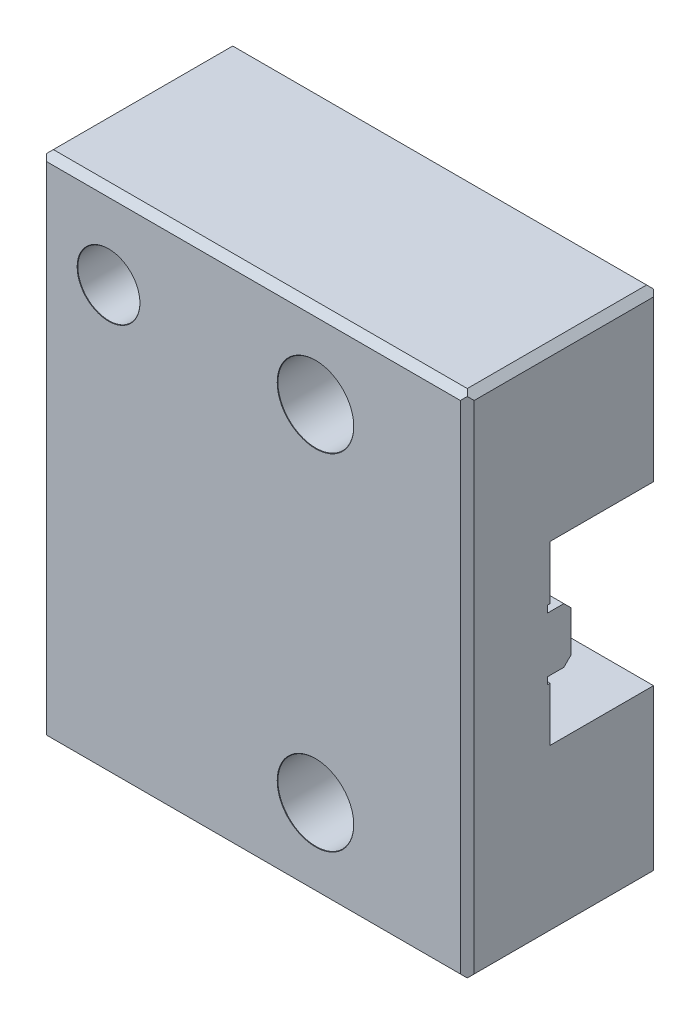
ISO-10303-21;
HEADER;
FILE_DESCRIPTION(('STEP AP214'),'2;1');
FILE_NAME('part.step','',(''),(''),'','','');
FILE_SCHEMA(('AUTOMOTIVE_DESIGN { 1 0 10303 214 1 1 1 1 }'));
ENDSEC;
DATA;
#1=APPLICATION_CONTEXT('core data for automotive mechanical design processes');
#2=APPLICATION_PROTOCOL_DEFINITION('international standard','automotive_design',2000,#1);
#3=PRODUCT_CONTEXT('',#1,'mechanical');
#4=PRODUCT('Part','Part','',(#3));
#5=PRODUCT_RELATED_PRODUCT_CATEGORY('part','',(#4));
#6=PRODUCT_DEFINITION_FORMATION('','',#4);
#7=PRODUCT_DEFINITION_CONTEXT('part definition',#1,'design');
#8=PRODUCT_DEFINITION('design','',#6,#7);
#9=PRODUCT_DEFINITION_SHAPE('','',#8);
#10=(LENGTH_UNIT() NAMED_UNIT(*) SI_UNIT(.MILLI.,.METRE.));
#11=(NAMED_UNIT(*) PLANE_ANGLE_UNIT() SI_UNIT($,.RADIAN.));
#12=(NAMED_UNIT(*) SI_UNIT($,.STERADIAN.) SOLID_ANGLE_UNIT());
#13=UNCERTAINTY_MEASURE_WITH_UNIT(LENGTH_MEASURE(1.E-05),#10,'distance_accuracy_value','');
#14=(GEOMETRIC_REPRESENTATION_CONTEXT(3) GLOBAL_UNCERTAINTY_ASSIGNED_CONTEXT((#13)) GLOBAL_UNIT_ASSIGNED_CONTEXT((#10,
#11,#12)) REPRESENTATION_CONTEXT('',''));
#15=CARTESIAN_POINT('',(0.,0.,0.));
#16=DIRECTION('',(0.,0.,1.));
#17=DIRECTION('',(1.,0.,0.));
#18=AXIS2_PLACEMENT_3D('',#15,#16,#17);
#19=CARTESIAN_POINT('',(409.720096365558,3.36,25.69275697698));
#20=DIRECTION('',(0.,0.,-1.));
#21=DIRECTION('',(-1.,0.,0.));
#22=AXIS2_PLACEMENT_3D('',#19,#20,#21);
#23=CONICAL_SURFACE('',#22,1.65000000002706,1.02974425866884);
#24=CARTESIAN_POINT('',(409.720096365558,3.36000000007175,26.684176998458));
#25=VERTEX_POINT('',#24);
#26=VERTEX_LOOP('',#25);
#27=FACE_BOUND('',#26,.T.);
#28=CARTESIAN_POINT('',(409.720096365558,3.36,25.6927569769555));
#29=DIRECTION('',(0.,0.,-1.));
#30=DIRECTION('',(-1.,0.,0.));
#31=AXIS2_PLACEMENT_3D('',#28,#29,#30);
#32=CIRCLE('',#31,1.65);
#33=CARTESIAN_POINT('',(408.070096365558,3.36,25.6927569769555));
#34=VERTEX_POINT('',#33);
#35=EDGE_CURVE('E320',#34,#34,#32,.T.);
#36=ORIENTED_EDGE('',*,*,#35,.T.);
#37=EDGE_LOOP('',(#36));
#38=FACE_BOUND('',#37,.T.);
#39=ADVANCED_FACE('F16',(#27,#38),#23,.F.);
#40=CARTESIAN_POINT('',(393.720096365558,3.36,25.69275697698));
#41=DIRECTION('',(0.,0.,-1.));
#42=DIRECTION('',(-1.,0.,0.));
#43=AXIS2_PLACEMENT_3D('',#40,#41,#42);
#44=CONICAL_SURFACE('',#43,1.65000000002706,1.02974425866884);
#45=CARTESIAN_POINT('',(393.720096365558,3.36000000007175,26.684176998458));
#46=VERTEX_POINT('',#45);
#47=VERTEX_LOOP('',#46);
#48=FACE_BOUND('',#47,.T.);
#49=CARTESIAN_POINT('',(393.720096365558,3.36,25.6927569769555));
#50=DIRECTION('',(0.,0.,-1.));
#51=DIRECTION('',(-1.,0.,0.));
#52=AXIS2_PLACEMENT_3D('',#49,#50,#51);
#53=CIRCLE('',#52,1.65);
#54=CARTESIAN_POINT('',(392.070096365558,3.36,25.6927569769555));
#55=VERTEX_POINT('',#54);
#56=EDGE_CURVE('E340',#55,#55,#53,.T.);
#57=ORIENTED_EDGE('',*,*,#56,.T.);
#58=EDGE_LOOP('',(#57));
#59=FACE_BOUND('',#58,.T.);
#60=ADVANCED_FACE('F808',(#48,#59),#44,.F.);
#61=CARTESIAN_POINT('',(393.720096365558,30.36,25.69275697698));
#62=DIRECTION('',(0.,0.,-1.));
#63=DIRECTION('',(-1.,0.,0.));
#64=AXIS2_PLACEMENT_3D('',#61,#62,#63);
#65=CONICAL_SURFACE('',#64,1.64999999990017,1.02974425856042);
#66=CARTESIAN_POINT('',(393.720096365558,30.360000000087,26.6841769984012));
#67=VERTEX_POINT('',#66);
#68=VERTEX_LOOP('',#67);
#69=FACE_BOUND('',#68,.T.);
#70=CARTESIAN_POINT('',(393.720096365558,30.36,25.6927569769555));
#71=DIRECTION('',(0.,0.,-1.));
#72=DIRECTION('',(-1.,0.,0.));
#73=AXIS2_PLACEMENT_3D('',#70,#71,#72);
#74=CIRCLE('',#73,1.65);
#75=CARTESIAN_POINT('',(392.070096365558,30.36,25.6927569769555));
#76=VERTEX_POINT('',#75);
#77=EDGE_CURVE('E337',#76,#76,#74,.T.);
#78=ORIENTED_EDGE('',*,*,#77,.T.);
#79=EDGE_LOOP('',(#78));
#80=FACE_BOUND('',#79,.T.);
#81=ADVANCED_FACE('F804',(#69,#80),#65,.F.);
#82=CARTESIAN_POINT('',(409.720096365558,30.36,25.69275697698));
#83=DIRECTION('',(0.,0.,-1.));
#84=DIRECTION('',(-1.,0.,0.));
#85=AXIS2_PLACEMENT_3D('',#82,#83,#84);
#86=CONICAL_SURFACE('',#85,1.64999999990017,1.02974425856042);
#87=CARTESIAN_POINT('',(409.720096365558,30.360000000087,26.6841769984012));
#88=VERTEX_POINT('',#87);
#89=VERTEX_LOOP('',#88);
#90=FACE_BOUND('',#89,.T.);
#91=CARTESIAN_POINT('',(409.720096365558,30.36,25.6927569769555));
#92=DIRECTION('',(0.,0.,-1.));
#93=DIRECTION('',(-1.,0.,0.));
#94=AXIS2_PLACEMENT_3D('',#91,#92,#93);
#95=CIRCLE('',#94,1.65);
#96=CARTESIAN_POINT('',(408.070096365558,30.36,25.6927569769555));
#97=VERTEX_POINT('',#96);
#98=EDGE_CURVE('E316',#97,#97,#95,.T.);
#99=ORIENTED_EDGE('',*,*,#98,.T.);
#100=EDGE_LOOP('',(#99));
#101=FACE_BOUND('',#100,.T.);
#102=ADVANCED_FACE('F800',(#90,#101),#86,.F.);
#103=CARTESIAN_POINT('',(425.720098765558,19.36,21.6927569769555));
#104=DIRECTION('',(0.,0.,1.));
#105=DIRECTION('',(1.,0.,0.));
#106=AXIS2_PLACEMENT_3D('',#103,#104,#105);
#107=PLANE('',#106);
#108=DIRECTION('',(1.,0.,0.));
#109=VECTOR('',#108,1.);
#110=CARTESIAN_POINT('',(425.720098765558,19.36,21.6927569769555));
#111=LINE('',#110,#109);
#112=CARTESIAN_POINT('',(381.720096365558,19.36,21.6927569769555));
#113=VERTEX_POINT('',#112);
#114=CARTESIAN_POINT('',(412.720096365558,19.36,21.6927569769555));
#115=VERTEX_POINT('',#114);
#116=EDGE_CURVE('E311',#113,#115,#111,.T.);
#117=ORIENTED_EDGE('',*,*,#116,.T.);
#118=DIRECTION('',(0.,-1.,0.));
#119=VECTOR('',#118,1.);
#120=CARTESIAN_POINT('',(412.720096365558,19.36,21.6927569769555));
#121=LINE('',#120,#119);
#122=CARTESIAN_POINT('',(412.720096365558,18.86,21.6927569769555));
#123=VERTEX_POINT('',#122);
#124=EDGE_CURVE('E541',#115,#123,#121,.T.);
#125=ORIENTED_EDGE('',*,*,#124,.T.);
#126=DIRECTION('',(1.,0.,0.));
#127=VECTOR('',#126,1.);
#128=CARTESIAN_POINT('',(425.220098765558,18.86,21.6927569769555));
#129=LINE('',#128,#127);
#130=CARTESIAN_POINT('',(381.720096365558,18.86,21.6927569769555));
#131=VERTEX_POINT('',#130);
#132=EDGE_CURVE('E326',#123,#131,#129,.F.);
#133=ORIENTED_EDGE('',*,*,#132,.T.);
#134=DIRECTION('',(0.,1.,0.));
#135=VECTOR('',#134,1.);
#136=CARTESIAN_POINT('',(381.720096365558,19.36,21.6927569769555));
#137=LINE('',#136,#135);
#138=EDGE_CURVE('E331',#113,#131,#137,.F.);
#139=ORIENTED_EDGE('',*,*,#138,.F.);
#140=EDGE_LOOP('',(#117,#125,#133,#139));
#141=FACE_BOUND('',#140,.T.);
#142=ADVANCED_FACE('F796',(#141),#107,.F.);
#143=CARTESIAN_POINT('',(425.720098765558,14.86,20.8927569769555));
#144=DIRECTION('',(0.,1.,0.));
#145=DIRECTION('',(0.,0.,1.));
#146=AXIS2_PLACEMENT_3D('',#143,#144,#145);
#147=PLANE('',#146);
#148=DIRECTION('',(1.,0.,0.));
#149=VECTOR('',#148,1.);
#150=CARTESIAN_POINT('',(401.720096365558,14.86,20.4927569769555));
#151=LINE('',#150,#149);
#152=CARTESIAN_POINT('',(381.720096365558,14.86,20.4927569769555));
#153=VERTEX_POINT('',#152);
#154=CARTESIAN_POINT('',(412.720096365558,14.86,20.4927569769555));
#155=VERTEX_POINT('',#154);
#156=EDGE_CURVE('E306',#153,#155,#151,.T.);
#157=ORIENTED_EDGE('',*,*,#156,.T.);
#158=DIRECTION('',(0.,0.,1.));
#159=VECTOR('',#158,1.);
#160=CARTESIAN_POINT('',(412.720096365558,14.86,20.8927569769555));
#161=LINE('',#160,#159);
#162=CARTESIAN_POINT('',(412.720096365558,14.86,21.6927569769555));
#163=VERTEX_POINT('',#162);
#164=EDGE_CURVE('E556',#155,#163,#161,.T.);
#165=ORIENTED_EDGE('',*,*,#164,.T.);
#166=DIRECTION('',(1.,0.,0.));
#167=VECTOR('',#166,1.);
#168=CARTESIAN_POINT('',(425.720098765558,14.86,21.6927569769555));
#169=LINE('',#168,#167);
#170=CARTESIAN_POINT('',(381.720096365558,14.86,21.6927569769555));
#171=VERTEX_POINT('',#170);
#172=EDGE_CURVE('E321',#163,#171,#169,.F.);
#173=ORIENTED_EDGE('',*,*,#172,.T.);
#174=DIRECTION('',(0.,0.,1.));
#175=VECTOR('',#174,1.);
#176=CARTESIAN_POINT('',(381.720096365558,14.86,20.8927569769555));
#177=LINE('',#176,#175);
#178=EDGE_CURVE('E328',#153,#171,#177,.T.);
#179=ORIENTED_EDGE('',*,*,#178,.F.);
#180=EDGE_LOOP('',(#157,#165,#173,#179));
#181=FACE_BOUND('',#180,.T.);
#182=ADVANCED_FACE('F792',(#181),#147,.F.);
#183=CARTESIAN_POINT('',(425.220098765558,18.86,21.4927569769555));
#184=DIRECTION('',(0.,-1.,0.));
#185=DIRECTION('',(0.,0.,-1.));
#186=AXIS2_PLACEMENT_3D('',#183,#184,#185);
#187=PLANE('',#186);
#188=ORIENTED_EDGE('',*,*,#132,.F.);
#189=DIRECTION('',(0.,0.,-1.));
#190=VECTOR('',#189,1.);
#191=CARTESIAN_POINT('',(412.720096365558,18.86,21.4927569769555));
#192=LINE('',#191,#190);
#193=CARTESIAN_POINT('',(412.720096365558,18.86,20.4927569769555));
#194=VERTEX_POINT('',#193);
#195=EDGE_CURVE('E544',#123,#194,#192,.T.);
#196=ORIENTED_EDGE('',*,*,#195,.T.);
#197=DIRECTION('',(1.,0.,0.));
#198=VECTOR('',#197,1.);
#199=CARTESIAN_POINT('',(401.720096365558,18.86,20.4927569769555));
#200=LINE('',#199,#198);
#201=CARTESIAN_POINT('',(381.720096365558,18.86,20.4927569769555));
#202=VERTEX_POINT('',#201);
#203=EDGE_CURVE('E304',#194,#202,#200,.F.);
#204=ORIENTED_EDGE('',*,*,#203,.T.);
#205=DIRECTION('',(0.,0.,-1.));
#206=VECTOR('',#205,1.);
#207=CARTESIAN_POINT('',(381.720096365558,18.86,21.4927569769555));
#208=LINE('',#207,#206);
#209=EDGE_CURVE('E323',#131,#202,#208,.T.);
#210=ORIENTED_EDGE('',*,*,#209,.F.);
#211=EDGE_LOOP('',(#188,#196,#204,#210));
#212=FACE_BOUND('',#211,.T.);
#213=ADVANCED_FACE('F788',(#212),#187,.F.);
#214=CARTESIAN_POINT('',(425.720098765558,14.86,21.6927569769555));
#215=DIRECTION('',(0.,0.,1.));
#216=DIRECTION('',(1.,0.,0.));
#217=AXIS2_PLACEMENT_3D('',#214,#215,#216);
#218=PLANE('',#217);
#219=ORIENTED_EDGE('',*,*,#172,.F.);
#220=DIRECTION('',(0.,-1.,0.));
#221=VECTOR('',#220,1.);
#222=CARTESIAN_POINT('',(412.720096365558,14.86,21.6927569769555));
#223=LINE('',#222,#221);
#224=CARTESIAN_POINT('',(412.720096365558,14.36,21.6927569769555));
#225=VERTEX_POINT('',#224);
#226=EDGE_CURVE('E559',#163,#225,#223,.T.);
#227=ORIENTED_EDGE('',*,*,#226,.T.);
#228=DIRECTION('',(1.,0.,0.));
#229=VECTOR('',#228,1.);
#230=CARTESIAN_POINT('',(425.720098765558,14.36,21.6927569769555));
#231=LINE('',#230,#229);
#232=CARTESIAN_POINT('',(381.720096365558,14.36,21.6927569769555));
#233=VERTEX_POINT('',#232);
#234=EDGE_CURVE('E299',#225,#233,#231,.F.);
#235=ORIENTED_EDGE('',*,*,#234,.T.);
#236=DIRECTION('',(0.,1.,0.));
#237=VECTOR('',#236,1.);
#238=CARTESIAN_POINT('',(381.720096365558,14.86,21.6927569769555));
#239=LINE('',#238,#237);
#240=EDGE_CURVE('E317',#171,#233,#239,.F.);
#241=ORIENTED_EDGE('',*,*,#240,.F.);
#242=EDGE_LOOP('',(#219,#227,#235,#241));
#243=FACE_BOUND('',#242,.T.);
#244=ADVANCED_FACE('F784',(#243),#218,.F.);
#245=CARTESIAN_POINT('',(425.720098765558,19.36,21.1927569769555));
#246=DIRECTION('',(0.,1.,0.));
#247=DIRECTION('',(0.,0.,1.));
#248=AXIS2_PLACEMENT_3D('',#245,#246,#247);
#249=PLANE('',#248);
#250=DIRECTION('',(1.,0.,0.));
#251=VECTOR('',#250,1.);
#252=CARTESIAN_POINT('',(425.220098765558,19.36,21.4927569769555));
#253=LINE('',#252,#251);
#254=CARTESIAN_POINT('',(381.720096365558,19.36,21.4927569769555));
#255=VERTEX_POINT('',#254);
#256=CARTESIAN_POINT('',(412.720096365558,19.36,21.4927569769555));
#257=VERTEX_POINT('',#256);
#258=EDGE_CURVE('E277',#255,#257,#253,.T.);
#259=ORIENTED_EDGE('',*,*,#258,.T.);
#260=DIRECTION('',(0.,0.,1.));
#261=VECTOR('',#260,1.);
#262=CARTESIAN_POINT('',(412.720096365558,19.36,21.1927569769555));
#263=LINE('',#262,#261);
#264=EDGE_CURVE('E538',#257,#115,#263,.T.);
#265=ORIENTED_EDGE('',*,*,#264,.T.);
#266=ORIENTED_EDGE('',*,*,#116,.F.);
#267=DIRECTION('',(0.,0.,1.));
#268=VECTOR('',#267,1.);
#269=CARTESIAN_POINT('',(381.720096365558,19.36,21.1927569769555));
#270=LINE('',#269,#268);
#271=EDGE_CURVE('E314',#255,#113,#270,.T.);
#272=ORIENTED_EDGE('',*,*,#271,.F.);
#273=EDGE_LOOP('',(#259,#265,#266,#272));
#274=FACE_BOUND('',#273,.T.);
#275=ADVANCED_FACE('F780',(#274),#249,.F.);
#276=CARTESIAN_POINT('',(401.720096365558,15.11,20.2427569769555));
#277=DIRECTION('',(0.,0.707106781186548,0.707106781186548));
#278=DIRECTION('',(0.,-0.707106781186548,0.707106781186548));
#279=AXIS2_PLACEMENT_3D('',#276,#277,#278);
#280=PLANE('',#279);
#281=DIRECTION('',(1.,0.,0.));
#282=VECTOR('',#281,1.);
#283=CARTESIAN_POINT('',(425.220098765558,15.36,19.9927569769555));
#284=LINE('',#283,#282);
#285=CARTESIAN_POINT('',(381.720096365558,15.36,19.9927569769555));
#286=VERTEX_POINT('',#285);
#287=CARTESIAN_POINT('',(412.720096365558,15.36,19.9927569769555));
#288=VERTEX_POINT('',#287);
#289=EDGE_CURVE('E272',#286,#288,#284,.T.);
#290=ORIENTED_EDGE('',*,*,#289,.T.);
#291=DIRECTION('',(0.,-0.707106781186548,0.707106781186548));
#292=VECTOR('',#291,1.);
#293=CARTESIAN_POINT('',(412.720096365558,15.11,20.2427569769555));
#294=LINE('',#293,#292);
#295=EDGE_CURVE('E553',#288,#155,#294,.T.);
#296=ORIENTED_EDGE('',*,*,#295,.T.);
#297=ORIENTED_EDGE('',*,*,#156,.F.);
#298=DIRECTION('',(0.,-0.707106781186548,0.707106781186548));
#299=VECTOR('',#298,1.);
#300=CARTESIAN_POINT('',(381.720096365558,15.11,20.2427569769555));
#301=LINE('',#300,#299);
#302=EDGE_CURVE('E309',#286,#153,#301,.T.);
#303=ORIENTED_EDGE('',*,*,#302,.F.);
#304=EDGE_LOOP('',(#290,#296,#297,#303));
#305=FACE_BOUND('',#304,.T.);
#306=ADVANCED_FACE('F776',(#305),#280,.F.);
#307=CARTESIAN_POINT('',(401.720096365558,18.61,20.2427569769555));
#308=DIRECTION('',(0.,-0.707106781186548,0.707106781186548));
#309=DIRECTION('',(0.,-0.707106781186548,-0.707106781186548));
#310=AXIS2_PLACEMENT_3D('',#307,#308,#309);
#311=PLANE('',#310);
#312=ORIENTED_EDGE('',*,*,#203,.F.);
#313=DIRECTION('',(0.,-0.707106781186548,-0.707106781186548));
#314=VECTOR('',#313,1.);
#315=CARTESIAN_POINT('',(412.720096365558,18.61,20.2427569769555));
#316=LINE('',#315,#314);
#317=CARTESIAN_POINT('',(412.720096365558,18.36,19.9927569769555));
#318=VERTEX_POINT('',#317);
#319=EDGE_CURVE('E547',#194,#318,#316,.T.);
#320=ORIENTED_EDGE('',*,*,#319,.T.);
#321=DIRECTION('',(1.,0.,0.));
#322=VECTOR('',#321,1.);
#323=CARTESIAN_POINT('',(425.220098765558,18.36,19.9927569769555));
#324=LINE('',#323,#322);
#325=CARTESIAN_POINT('',(381.720096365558,18.36,19.9927569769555));
#326=VERTEX_POINT('',#325);
#327=EDGE_CURVE('E267',#318,#326,#324,.F.);
#328=ORIENTED_EDGE('',*,*,#327,.T.);
#329=DIRECTION('',(0.,-0.707106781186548,-0.707106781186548));
#330=VECTOR('',#329,1.);
#331=CARTESIAN_POINT('',(381.720096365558,18.61,20.2427569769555));
#332=LINE('',#331,#330);
#333=EDGE_CURVE('E301',#202,#326,#332,.T.);
#334=ORIENTED_EDGE('',*,*,#333,.F.);
#335=EDGE_LOOP('',(#312,#320,#328,#334));
#336=FACE_BOUND('',#335,.T.);
#337=ADVANCED_FACE('F772',(#336),#311,.F.);
#338=CARTESIAN_POINT('',(425.720098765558,14.36,21.6927569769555));
#339=DIRECTION('',(0.,-1.,0.));
#340=DIRECTION('',(0.,0.,-1.));
#341=AXIS2_PLACEMENT_3D('',#338,#339,#340);
#342=PLANE('',#341);
#343=ORIENTED_EDGE('',*,*,#234,.F.);
#344=DIRECTION('',(0.,0.,-1.));
#345=VECTOR('',#344,1.);
#346=CARTESIAN_POINT('',(412.720096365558,14.36,21.6927569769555));
#347=LINE('',#346,#345);
#348=CARTESIAN_POINT('',(412.720096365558,14.36,21.4927569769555));
#349=VERTEX_POINT('',#348);
#350=EDGE_CURVE('E257',#225,#349,#347,.T.);
#351=ORIENTED_EDGE('',*,*,#350,.T.);
#352=DIRECTION('',(1.,0.,0.));
#353=VECTOR('',#352,1.);
#354=CARTESIAN_POINT('',(425.220098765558,14.36,21.4927569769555));
#355=LINE('',#354,#353);
#356=CARTESIAN_POINT('',(381.720096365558,14.36,21.4927569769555));
#357=VERTEX_POINT('',#356);
#358=EDGE_CURVE('E256',#349,#357,#355,.F.);
#359=ORIENTED_EDGE('',*,*,#358,.T.);
#360=DIRECTION('',(0.,0.,-1.));
#361=VECTOR('',#360,1.);
#362=CARTESIAN_POINT('',(381.720096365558,14.36,21.6927569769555));
#363=LINE('',#362,#361);
#364=EDGE_CURVE('E296',#233,#357,#363,.T.);
#365=ORIENTED_EDGE('',*,*,#364,.F.);
#366=EDGE_LOOP('',(#343,#351,#359,#365));
#367=FACE_BOUND('',#366,.T.);
#368=ADVANCED_FACE('F768',(#367),#342,.F.);
#369=CARTESIAN_POINT('',(409.720096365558,3.36,13.4927569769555));
#370=DIRECTION('',(0.,0.,-1.));
#371=DIRECTION('',(-1.,0.,0.));
#372=AXIS2_PLACEMENT_3D('',#369,#370,#371);
#373=CYLINDRICAL_SURFACE('',#372,1.65);
#374=ORIENTED_EDGE('',*,*,#35,.F.);
#375=EDGE_LOOP('',(#374));
#376=FACE_BOUND('',#375,.T.);
#377=CARTESIAN_POINT('',(409.720096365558,3.36,13.4927569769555));
#378=DIRECTION('',(0.,0.,-1.));
#379=DIRECTION('',(-1.,0.,0.));
#380=AXIS2_PLACEMENT_3D('',#377,#378,#379);
#381=CIRCLE('',#380,1.65);
#382=CARTESIAN_POINT('',(408.070096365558,3.36,13.4927569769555));
#383=VERTEX_POINT('',#382);
#384=EDGE_CURVE('E357',#383,#383,#381,.F.);
#385=ORIENTED_EDGE('',*,*,#384,.F.);
#386=EDGE_LOOP('',(#385));
#387=FACE_BOUND('',#386,.T.);
#388=ADVANCED_FACE('F764',(#376,#387),#373,.F.);
#389=CARTESIAN_POINT('',(393.720096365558,3.36,13.4927569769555));
#390=DIRECTION('',(0.,0.,-1.));
#391=DIRECTION('',(-1.,0.,0.));
#392=AXIS2_PLACEMENT_3D('',#389,#390,#391);
#393=CYLINDRICAL_SURFACE('',#392,1.65);
#394=ORIENTED_EDGE('',*,*,#56,.F.);
#395=EDGE_LOOP('',(#394));
#396=FACE_BOUND('',#395,.T.);
#397=CARTESIAN_POINT('',(393.720096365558,3.36,13.4927569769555));
#398=DIRECTION('',(0.,0.,-1.));
#399=DIRECTION('',(-1.,0.,0.));
#400=AXIS2_PLACEMENT_3D('',#397,#398,#399);
#401=CIRCLE('',#400,1.65);
#402=CARTESIAN_POINT('',(392.070096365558,3.36,13.4927569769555));
#403=VERTEX_POINT('',#402);
#404=EDGE_CURVE('E353',#403,#403,#401,.F.);
#405=ORIENTED_EDGE('',*,*,#404,.F.);
#406=EDGE_LOOP('',(#405));
#407=FACE_BOUND('',#406,.T.);
#408=ADVANCED_FACE('F761',(#396,#407),#393,.F.);
#409=CARTESIAN_POINT('',(401.720096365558,10.21,13.7427569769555));
#410=DIRECTION('',(0.,-0.707106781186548,0.707106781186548));
#411=DIRECTION('',(0.,-0.707106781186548,-0.707106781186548));
#412=AXIS2_PLACEMENT_3D('',#409,#410,#411);
#413=PLANE('',#412);
#414=DIRECTION('',(1.,0.,0.));
#415=VECTOR('',#414,1.);
#416=CARTESIAN_POINT('',(425.220098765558,10.46,13.9927569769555));
#417=LINE('',#416,#415);
#418=CARTESIAN_POINT('',(381.720096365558,10.46,13.9927569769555));
#419=VERTEX_POINT('',#418);
#420=CARTESIAN_POINT('',(412.720096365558,10.46,13.9927569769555));
#421=VERTEX_POINT('',#420);
#422=EDGE_CURVE('E263',#419,#421,#417,.T.);
#423=ORIENTED_EDGE('',*,*,#422,.T.);
#424=DIRECTION('',(-0.577350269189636,-0.57735026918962,-0.57735026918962));
#425=VECTOR('',#424,1.);
#426=CARTESIAN_POINT('',(408.686763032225,6.42666666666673,9.95942364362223));
#427=LINE('',#426,#425);
#428=CARTESIAN_POINT('',(412.220096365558,9.96,13.4927569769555));
#429=VERTEX_POINT('',#428);
#430=EDGE_CURVE('E371',#421,#429,#427,.T.);
#431=ORIENTED_EDGE('',*,*,#430,.T.);
#432=DIRECTION('',(-1.,0.,0.));
#433=VECTOR('',#432,1.);
#434=CARTESIAN_POINT('',(421.720096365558,9.96,13.4927569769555));
#435=LINE('',#434,#433);
#436=CARTESIAN_POINT('',(382.220096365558,9.96,13.4927569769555));
#437=VERTEX_POINT('',#436);
#438=EDGE_CURVE('E352',#437,#429,#435,.F.);
#439=ORIENTED_EDGE('',*,*,#438,.F.);
#440=DIRECTION('',(-0.577350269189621,0.577350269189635,0.577350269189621));
#441=VECTOR('',#440,1.);
#442=CARTESIAN_POINT('',(382.220096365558,9.96,13.4927569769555));
#443=LINE('',#442,#441);
#444=EDGE_CURVE('E265',#437,#419,#443,.T.);
#445=ORIENTED_EDGE('',*,*,#444,.T.);
#446=EDGE_LOOP('',(#423,#431,#439,#445));
#447=FACE_BOUND('',#446,.T.);
#448=ADVANCED_FACE('F458',(#447),#413,.F.);
#449=CARTESIAN_POINT('',(393.720096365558,30.36,13.4927569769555));
#450=DIRECTION('',(0.,0.,-1.));
#451=DIRECTION('',(-1.,0.,0.));
#452=AXIS2_PLACEMENT_3D('',#449,#450,#451);
#453=CYLINDRICAL_SURFACE('',#452,1.65);
#454=ORIENTED_EDGE('',*,*,#77,.F.);
#455=EDGE_LOOP('',(#454));
#456=FACE_BOUND('',#455,.T.);
#457=CARTESIAN_POINT('',(393.720096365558,30.36,13.4927569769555));
#458=DIRECTION('',(0.,0.,-1.));
#459=DIRECTION('',(-1.,0.,0.));
#460=AXIS2_PLACEMENT_3D('',#457,#458,#459);
#461=CIRCLE('',#460,1.65);
#462=CARTESIAN_POINT('',(392.070096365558,30.36,13.4927569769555));
#463=VERTEX_POINT('',#462);
#464=EDGE_CURVE('E349',#463,#463,#461,.F.);
#465=ORIENTED_EDGE('',*,*,#464,.F.);
#466=EDGE_LOOP('',(#465));
#467=FACE_BOUND('',#466,.T.);
#468=ADVANCED_FACE('F754',(#456,#467),#453,.F.);
#469=CARTESIAN_POINT('',(409.720096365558,30.36,13.4927569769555));
#470=DIRECTION('',(0.,0.,-1.));
#471=DIRECTION('',(-1.,0.,0.));
#472=AXIS2_PLACEMENT_3D('',#469,#470,#471);
#473=CYLINDRICAL_SURFACE('',#472,1.65);
#474=ORIENTED_EDGE('',*,*,#98,.F.);
#475=EDGE_LOOP('',(#474));
#476=FACE_BOUND('',#475,.T.);
#477=CARTESIAN_POINT('',(409.720096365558,30.36,13.4927569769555));
#478=DIRECTION('',(0.,0.,-1.));
#479=DIRECTION('',(-1.,0.,0.));
#480=AXIS2_PLACEMENT_3D('',#477,#478,#479);
#481=CIRCLE('',#480,1.65);
#482=CARTESIAN_POINT('',(408.070096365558,30.36,13.4927569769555));
#483=VERTEX_POINT('',#482);
#484=EDGE_CURVE('E345',#483,#483,#481,.F.);
#485=ORIENTED_EDGE('',*,*,#484,.F.);
#486=EDGE_LOOP('',(#485));
#487=FACE_BOUND('',#486,.T.);
#488=ADVANCED_FACE('F750',(#476,#487),#473,.F.);
#489=CARTESIAN_POINT('',(401.720096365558,23.51,13.7427569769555));
#490=DIRECTION('',(0.,-0.707106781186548,-0.707106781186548));
#491=DIRECTION('',(0.,0.707106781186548,-0.707106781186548));
#492=AXIS2_PLACEMENT_3D('',#489,#490,#491);
#493=PLANE('',#492);
#494=DIRECTION('',(-1.,0.,0.));
#495=VECTOR('',#494,1.);
#496=CARTESIAN_POINT('',(421.720096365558,23.76,13.4927569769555));
#497=LINE('',#496,#495);
#498=CARTESIAN_POINT('',(412.220096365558,23.76,13.4927569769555));
#499=VERTEX_POINT('',#498);
#500=CARTESIAN_POINT('',(382.220096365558,23.76,13.4927569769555));
#501=VERTEX_POINT('',#500);
#502=EDGE_CURVE('E348',#499,#501,#497,.T.);
#503=ORIENTED_EDGE('',*,*,#502,.F.);
#504=DIRECTION('',(0.577350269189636,-0.57735026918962,0.57735026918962));
#505=VECTOR('',#504,1.);
#506=CARTESIAN_POINT('',(408.886763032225,27.0933333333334,10.1594236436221));
#507=LINE('',#506,#505);
#508=CARTESIAN_POINT('',(412.720096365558,23.26,13.9927569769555));
#509=VERTEX_POINT('',#508);
#510=EDGE_CURVE('E385',#499,#509,#507,.T.);
#511=ORIENTED_EDGE('',*,*,#510,.T.);
#512=DIRECTION('',(1.,0.,0.));
#513=VECTOR('',#512,1.);
#514=CARTESIAN_POINT('',(425.220098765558,23.26,13.9927569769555));
#515=LINE('',#514,#513);
#516=CARTESIAN_POINT('',(381.720096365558,23.26,13.9927569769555));
#517=VERTEX_POINT('',#516);
#518=EDGE_CURVE('E280',#509,#517,#515,.F.);
#519=ORIENTED_EDGE('',*,*,#518,.T.);
#520=DIRECTION('',(0.577350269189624,0.577350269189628,-0.577350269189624));
#521=VECTOR('',#520,1.);
#522=CARTESIAN_POINT('',(381.720096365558,23.26,13.9927569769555));
#523=LINE('',#522,#521);
#524=EDGE_CURVE('E286',#517,#501,#523,.T.);
#525=ORIENTED_EDGE('',*,*,#524,.T.);
#526=EDGE_LOOP('',(#503,#511,#519,#525));
#527=FACE_BOUND('',#526,.T.);
#528=ADVANCED_FACE('F747',(#527),#493,.T.);
#529=CARTESIAN_POINT('',(401.720096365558,35.11,13.7427569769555));
#530=DIRECTION('',(0.,0.707106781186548,-0.707106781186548));
#531=DIRECTION('',(0.,0.707106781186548,0.707106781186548));
#532=AXIS2_PLACEMENT_3D('',#529,#530,#531);
#533=PLANE('',#532);
#534=DIRECTION('',(0.577350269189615,-0.577350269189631,-0.577350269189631));
#535=VECTOR('',#534,1.);
#536=CARTESIAN_POINT('',(408.886763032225,38.6933333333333,17.3260903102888));
#537=LINE('',#536,#535);
#538=CARTESIAN_POINT('',(412.220096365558,35.36,13.9927569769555));
#539=VERTEX_POINT('',#538);
#540=CARTESIAN_POINT('',(412.470096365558,35.11,13.7427569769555));
#541=VERTEX_POINT('',#540);
#542=EDGE_CURVE('E379',#539,#541,#537,.T.);
#543=ORIENTED_EDGE('',*,*,#542,.T.);
#544=DIRECTION('',(-0.577350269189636,-0.57735026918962,-0.57735026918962));
#545=VECTOR('',#544,1.);
#546=CARTESIAN_POINT('',(408.886763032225,31.5266666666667,10.1594236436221));
#547=LINE('',#546,#545);
#548=CARTESIAN_POINT('',(412.220096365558,34.86,13.4927569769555));
#549=VERTEX_POINT('',#548);
#550=EDGE_CURVE('E381',#541,#549,#547,.T.);
#551=ORIENTED_EDGE('',*,*,#550,.T.);
#552=DIRECTION('',(-1.,0.,0.));
#553=VECTOR('',#552,1.);
#554=CARTESIAN_POINT('',(421.720096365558,34.86,13.4927569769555));
#555=LINE('',#554,#553);
#556=CARTESIAN_POINT('',(382.220096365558,34.86,13.4927569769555));
#557=VERTEX_POINT('',#556);
#558=EDGE_CURVE('E423',#557,#549,#555,.F.);
#559=ORIENTED_EDGE('',*,*,#558,.F.);
#560=DIRECTION('',(-0.577350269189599,0.577350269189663,0.577350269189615));
#561=VECTOR('',#560,1.);
#562=CARTESIAN_POINT('',(382.220096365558,34.86,13.4927569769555));
#563=LINE('',#562,#561);
#564=CARTESIAN_POINT('',(381.970096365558,35.11,13.7427569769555));
#565=VERTEX_POINT('',#564);
#566=EDGE_CURVE('E284',#557,#565,#563,.T.);
#567=ORIENTED_EDGE('',*,*,#566,.T.);
#568=DIRECTION('',(0.577350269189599,0.577350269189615,0.577350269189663));
#569=VECTOR('',#568,1.);
#570=CARTESIAN_POINT('',(381.970096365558,35.11,13.7427569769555));
#571=LINE('',#570,#569);
#572=CARTESIAN_POINT('',(382.220096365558,35.36,13.9927569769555));
#573=VERTEX_POINT('',#572);
#574=EDGE_CURVE('E293',#565,#573,#571,.T.);
#575=ORIENTED_EDGE('',*,*,#574,.T.);
#576=DIRECTION('',(1.,0.,0.));
#577=VECTOR('',#576,1.);
#578=CARTESIAN_POINT('',(421.720096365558,35.36,13.9927569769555));
#579=LINE('',#578,#577);
#580=EDGE_CURVE('E432',#539,#573,#579,.F.);
#581=ORIENTED_EDGE('',*,*,#580,.F.);
#582=EDGE_LOOP('',(#543,#551,#559,#567,#575,#581));
#583=FACE_BOUND('',#582,.T.);
#584=ADVANCED_FACE('F422',(#583),#533,.T.);
#585=CARTESIAN_POINT('',(381.970096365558,35.11,20.4927569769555));
#586=DIRECTION('',(0.707106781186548,-0.707106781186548,0.));
#587=DIRECTION('',(0.707106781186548,0.707106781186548,0.));
#588=AXIS2_PLACEMENT_3D('',#585,#586,#587);
#589=PLANE('',#588);
#590=DIRECTION('',(-0.577350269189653,-0.577350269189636,-0.577350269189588));
#591=VECTOR('',#590,1.);
#592=CARTESIAN_POINT('',(381.970096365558,35.11,27.2427569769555));
#593=LINE('',#592,#591);
#594=CARTESIAN_POINT('',(381.970096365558,35.11,27.2427569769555));
#595=VERTEX_POINT('',#594);
#596=CARTESIAN_POINT('',(381.720096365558,34.86,26.9927569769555));
#597=VERTEX_POINT('',#596);
#598=EDGE_CURVE('E289',#595,#597,#593,.T.);
#599=ORIENTED_EDGE('',*,*,#598,.F.);
#600=DIRECTION('',(-0.577350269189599,-0.577350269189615,0.577350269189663));
#601=VECTOR('',#600,1.);
#602=CARTESIAN_POINT('',(382.220096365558,35.36,26.9927569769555));
#603=LINE('',#602,#601);
#604=CARTESIAN_POINT('',(382.220096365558,35.36,26.9927569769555));
#605=VERTEX_POINT('',#604);
#606=EDGE_CURVE('E291',#605,#595,#603,.T.);
#607=ORIENTED_EDGE('',*,*,#606,.F.);
#608=DIRECTION('',(0.,0.,1.));
#609=VECTOR('',#608,1.);
#610=CARTESIAN_POINT('',(382.220096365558,35.36,13.4927569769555));
#611=LINE('',#610,#609);
#612=EDGE_CURVE('E434',#573,#605,#611,.T.);
#613=ORIENTED_EDGE('',*,*,#612,.F.);
#614=ORIENTED_EDGE('',*,*,#574,.F.);
#615=DIRECTION('',(-0.577350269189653,-0.577350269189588,0.577350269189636));
#616=VECTOR('',#615,1.);
#617=CARTESIAN_POINT('',(381.970096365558,35.11,13.7427569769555));
#618=LINE('',#617,#616);
#619=CARTESIAN_POINT('',(381.720096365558,34.86,13.9927569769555));
#620=VERTEX_POINT('',#619);
#621=EDGE_CURVE('E282',#565,#620,#618,.T.);
#622=ORIENTED_EDGE('',*,*,#621,.T.);
#623=DIRECTION('',(0.,0.,1.));
#624=VECTOR('',#623,1.);
#625=CARTESIAN_POINT('',(381.720096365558,34.86,17.4927569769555));
#626=LINE('',#625,#624);
#627=EDGE_CURVE('E489',#597,#620,#626,.F.);
#628=ORIENTED_EDGE('',*,*,#627,.F.);
#629=EDGE_LOOP('',(#599,#607,#613,#614,#622,#628));
#630=FACE_BOUND('',#629,.T.);
#631=ADVANCED_FACE('F741',(#630),#589,.F.);
#632=CARTESIAN_POINT('',(381.970096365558,29.31,13.7427569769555));
#633=DIRECTION('',(0.707106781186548,0.,0.707106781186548));
#634=DIRECTION('',(0.707106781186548,0.,-0.707106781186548));
#635=AXIS2_PLACEMENT_3D('',#632,#633,#634);
#636=PLANE('',#635);
#637=ORIENTED_EDGE('',*,*,#621,.F.);
#638=ORIENTED_EDGE('',*,*,#566,.F.);
#639=DIRECTION('',(0.,1.,0.));
#640=VECTOR('',#639,1.);
#641=CARTESIAN_POINT('',(382.220096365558,10.46,13.4927569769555));
#642=LINE('',#641,#640);
#643=EDGE_CURVE('E431',#501,#557,#642,.T.);
#644=ORIENTED_EDGE('',*,*,#643,.F.);
#645=ORIENTED_EDGE('',*,*,#524,.F.);
#646=DIRECTION('',(0.,1.,0.));
#647=VECTOR('',#646,1.);
#648=CARTESIAN_POINT('',(381.720096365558,16.86,13.9927569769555));
#649=LINE('',#648,#647);
#650=EDGE_CURVE('E486',#620,#517,#649,.F.);
#651=ORIENTED_EDGE('',*,*,#650,.F.);
#652=EDGE_LOOP('',(#637,#638,#644,#645,#651));
#653=FACE_BOUND('',#652,.T.);
#654=ADVANCED_FACE('F737',(#653),#636,.F.);
#655=CARTESIAN_POINT('',(425.220098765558,23.26,13.4927569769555));
#656=DIRECTION('',(0.,1.,0.));
#657=DIRECTION('',(0.,0.,1.));
#658=AXIS2_PLACEMENT_3D('',#655,#656,#657);
#659=PLANE('',#658);
#660=ORIENTED_EDGE('',*,*,#518,.F.);
#661=DIRECTION('',(0.,0.,1.));
#662=VECTOR('',#661,1.);
#663=CARTESIAN_POINT('',(412.720096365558,23.26,13.4927569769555));
#664=LINE('',#663,#662);
#665=CARTESIAN_POINT('',(412.720096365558,23.26,21.4927569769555));
#666=VERTEX_POINT('',#665);
#667=EDGE_CURVE('E334',#509,#666,#664,.T.);
#668=ORIENTED_EDGE('',*,*,#667,.T.);
#669=DIRECTION('',(1.,0.,0.));
#670=VECTOR('',#669,1.);
#671=CARTESIAN_POINT('',(425.220098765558,23.26,21.4927569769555));
#672=LINE('',#671,#670);
#673=CARTESIAN_POINT('',(381.720096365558,23.26,21.4927569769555));
#674=VERTEX_POINT('',#673);
#675=EDGE_CURVE('E275',#666,#674,#672,.F.);
#676=ORIENTED_EDGE('',*,*,#675,.T.);
#677=DIRECTION('',(0.,0.,1.));
#678=VECTOR('',#677,1.);
#679=CARTESIAN_POINT('',(381.720096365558,23.26,17.4927569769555));
#680=LINE('',#679,#678);
#681=EDGE_CURVE('E483',#517,#674,#680,.T.);
#682=ORIENTED_EDGE('',*,*,#681,.F.);
#683=EDGE_LOOP('',(#660,#668,#676,#682));
#684=FACE_BOUND('',#683,.T.);
#685=ADVANCED_FACE('F733',(#684),#659,.F.);
#686=CARTESIAN_POINT('',(425.220098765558,23.26,21.4927569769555));
#687=DIRECTION('',(0.,0.,1.));
#688=DIRECTION('',(1.,0.,0.));
#689=AXIS2_PLACEMENT_3D('',#686,#687,#688);
#690=PLANE('',#689);
#691=ORIENTED_EDGE('',*,*,#675,.F.);
#692=DIRECTION('',(0.,-1.,0.));
#693=VECTOR('',#692,1.);
#694=CARTESIAN_POINT('',(412.720096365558,23.26,21.4927569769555));
#695=LINE('',#694,#693);
#696=EDGE_CURVE('E535',#666,#257,#695,.T.);
#697=ORIENTED_EDGE('',*,*,#696,.T.);
#698=ORIENTED_EDGE('',*,*,#258,.F.);
#699=DIRECTION('',(0.,1.,0.));
#700=VECTOR('',#699,1.);
#701=CARTESIAN_POINT('',(381.720096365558,16.86,21.4927569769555));
#702=LINE('',#701,#700);
#703=EDGE_CURVE('E480',#674,#255,#702,.F.);
#704=ORIENTED_EDGE('',*,*,#703,.F.);
#705=EDGE_LOOP('',(#691,#697,#698,#704));
#706=FACE_BOUND('',#705,.T.);
#707=ADVANCED_FACE('F729',(#706),#690,.F.);
#708=CARTESIAN_POINT('',(425.220098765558,18.86,19.9927569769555));
#709=DIRECTION('',(0.,0.,1.));
#710=DIRECTION('',(1.,0.,0.));
#711=AXIS2_PLACEMENT_3D('',#708,#709,#710);
#712=PLANE('',#711);
#713=ORIENTED_EDGE('',*,*,#327,.F.);
#714=DIRECTION('',(0.,-1.,0.));
#715=VECTOR('',#714,1.);
#716=CARTESIAN_POINT('',(412.720096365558,18.86,19.9927569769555));
#717=LINE('',#716,#715);
#718=EDGE_CURVE('E550',#318,#288,#717,.T.);
#719=ORIENTED_EDGE('',*,*,#718,.T.);
#720=ORIENTED_EDGE('',*,*,#289,.F.);
#721=DIRECTION('',(0.,1.,0.));
#722=VECTOR('',#721,1.);
#723=CARTESIAN_POINT('',(381.720096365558,16.86,19.9927569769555));
#724=LINE('',#723,#722);
#725=EDGE_CURVE('E474',#326,#286,#724,.F.);
#726=ORIENTED_EDGE('',*,*,#725,.F.);
#727=EDGE_LOOP('',(#713,#719,#720,#726));
#728=FACE_BOUND('',#727,.T.);
#729=ADVANCED_FACE('F726',(#728),#712,.F.);
#730=CARTESIAN_POINT('',(425.220098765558,14.86,21.4927569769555));
#731=DIRECTION('',(0.,0.,1.));
#732=DIRECTION('',(1.,0.,0.));
#733=AXIS2_PLACEMENT_3D('',#730,#731,#732);
#734=PLANE('',#733);
#735=ORIENTED_EDGE('',*,*,#358,.F.);
#736=DIRECTION('',(0.,-1.,0.));
#737=VECTOR('',#736,1.);
#738=CARTESIAN_POINT('',(412.720096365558,14.86,21.4927569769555));
#739=LINE('',#738,#737);
#740=CARTESIAN_POINT('',(412.720096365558,10.46,21.4927569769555));
#741=VERTEX_POINT('',#740);
#742=EDGE_CURVE('E241',#349,#741,#739,.T.);
#743=ORIENTED_EDGE('',*,*,#742,.T.);
#744=DIRECTION('',(1.,0.,0.));
#745=VECTOR('',#744,1.);
#746=CARTESIAN_POINT('',(425.220098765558,10.46,21.4927569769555));
#747=LINE('',#746,#745);
#748=CARTESIAN_POINT('',(381.720096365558,10.46,21.4927569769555));
#749=VERTEX_POINT('',#748);
#750=EDGE_CURVE('E254',#741,#749,#747,.F.);
#751=ORIENTED_EDGE('',*,*,#750,.T.);
#752=DIRECTION('',(0.,1.,0.));
#753=VECTOR('',#752,1.);
#754=CARTESIAN_POINT('',(381.720096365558,16.86,21.4927569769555));
#755=LINE('',#754,#753);
#756=EDGE_CURVE('E472',#357,#749,#755,.F.);
#757=ORIENTED_EDGE('',*,*,#756,.F.);
#758=EDGE_LOOP('',(#735,#743,#751,#757));
#759=FACE_BOUND('',#758,.T.);
#760=ADVANCED_FACE('F252',(#759),#734,.F.);
#761=CARTESIAN_POINT('',(425.220098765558,10.46,21.4927569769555));
#762=DIRECTION('',(0.,-1.,0.));
#763=DIRECTION('',(0.,0.,-1.));
#764=AXIS2_PLACEMENT_3D('',#761,#762,#763);
#765=PLANE('',#764);
#766=ORIENTED_EDGE('',*,*,#750,.F.);
#767=DIRECTION('',(0.,0.,-1.));
#768=VECTOR('',#767,1.);
#769=CARTESIAN_POINT('',(412.720096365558,10.46,21.4927569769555));
#770=LINE('',#769,#768);
#771=EDGE_CURVE('E238',#741,#421,#770,.T.);
#772=ORIENTED_EDGE('',*,*,#771,.T.);
#773=ORIENTED_EDGE('',*,*,#422,.F.);
#774=DIRECTION('',(0.,0.,1.));
#775=VECTOR('',#774,1.);
#776=CARTESIAN_POINT('',(381.720096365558,10.46,17.4927569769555));
#777=LINE('',#776,#775);
#778=EDGE_CURVE('E261',#749,#419,#777,.F.);
#779=ORIENTED_EDGE('',*,*,#778,.F.);
#780=EDGE_LOOP('',(#766,#772,#773,#779));
#781=FACE_BOUND('',#780,.T.);
#782=ADVANCED_FACE('F259',(#781),#765,.F.);
#783=CARTESIAN_POINT('',(381.970096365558,4.41,13.7427569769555));
#784=DIRECTION('',(0.707106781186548,0.,0.707106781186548));
#785=DIRECTION('',(0.707106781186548,0.,-0.707106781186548));
#786=AXIS2_PLACEMENT_3D('',#783,#784,#785);
#787=PLANE('',#786);
#788=ORIENTED_EDGE('',*,*,#444,.F.);
#789=DIRECTION('',(0.,1.,0.));
#790=VECTOR('',#789,1.);
#791=CARTESIAN_POINT('',(382.220096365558,10.46,13.4927569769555));
#792=LINE('',#791,#790);
#793=CARTESIAN_POINT('',(382.220096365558,-1.14,13.4927569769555));
#794=VERTEX_POINT('',#793);
#795=EDGE_CURVE('E442',#794,#437,#792,.T.);
#796=ORIENTED_EDGE('',*,*,#795,.F.);
#797=DIRECTION('',(0.577350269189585,0.577350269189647,-0.577350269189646));
#798=VECTOR('',#797,1.);
#799=CARTESIAN_POINT('',(381.970096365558,-1.39,13.7427569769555));
#800=LINE('',#799,#798);
#801=CARTESIAN_POINT('',(381.970096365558,-1.39,13.7427569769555));
#802=VERTEX_POINT('',#801);
#803=EDGE_CURVE('E360',#802,#794,#800,.T.);
#804=ORIENTED_EDGE('',*,*,#803,.F.);
#805=DIRECTION('',(-0.577350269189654,0.577350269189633,0.57735026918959));
#806=VECTOR('',#805,1.);
#807=CARTESIAN_POINT('',(381.970096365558,-1.39,13.7427569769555));
#808=LINE('',#807,#806);
#809=CARTESIAN_POINT('',(381.720096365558,-1.14,13.9927569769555));
#810=VERTEX_POINT('',#809);
#811=EDGE_CURVE('E451',#802,#810,#808,.T.);
#812=ORIENTED_EDGE('',*,*,#811,.T.);
#813=DIRECTION('',(0.,1.,0.));
#814=VECTOR('',#813,1.);
#815=CARTESIAN_POINT('',(381.720096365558,16.86,13.9927569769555));
#816=LINE('',#815,#814);
#817=EDGE_CURVE('E463',#419,#810,#816,.F.);
#818=ORIENTED_EDGE('',*,*,#817,.F.);
#819=EDGE_LOOP('',(#788,#796,#804,#812,#818));
#820=FACE_BOUND('',#819,.T.);
#821=ADVANCED_FACE('F464',(#820),#787,.F.);
#822=CARTESIAN_POINT('',(381.970096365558,-1.39,20.4927569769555));
#823=DIRECTION('',(0.707106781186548,0.707106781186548,0.));
#824=DIRECTION('',(-0.707106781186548,0.707106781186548,0.));
#825=AXIS2_PLACEMENT_3D('',#822,#823,#824);
#826=PLANE('',#825);
#827=ORIENTED_EDGE('',*,*,#811,.F.);
#828=DIRECTION('',(-0.577350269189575,0.57735026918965,-0.577350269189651));
#829=VECTOR('',#828,1.);
#830=CARTESIAN_POINT('',(382.220096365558,-1.64,13.9927569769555));
#831=LINE('',#830,#829);
#832=CARTESIAN_POINT('',(382.220096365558,-1.64,13.9927569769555));
#833=VERTEX_POINT('',#832);
#834=EDGE_CURVE('E448',#833,#802,#831,.T.);
#835=ORIENTED_EDGE('',*,*,#834,.F.);
#836=DIRECTION('',(0.,0.,-1.));
#837=VECTOR('',#836,1.);
#838=CARTESIAN_POINT('',(382.220096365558,-1.64,21.4927569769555));
#839=LINE('',#838,#837);
#840=CARTESIAN_POINT('',(382.220096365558,-1.64,26.9927569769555));
#841=VERTEX_POINT('',#840);
#842=EDGE_CURVE('E507',#841,#833,#839,.T.);
#843=ORIENTED_EDGE('',*,*,#842,.F.);
#844=DIRECTION('',(0.577350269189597,-0.577350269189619,-0.577350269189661));
#845=VECTOR('',#844,1.);
#846=CARTESIAN_POINT('',(381.970096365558,-1.39,27.2427569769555));
#847=LINE('',#846,#845);
#848=CARTESIAN_POINT('',(381.970096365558,-1.39,27.2427569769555));
#849=VERTEX_POINT('',#848);
#850=EDGE_CURVE('E453',#849,#841,#847,.T.);
#851=ORIENTED_EDGE('',*,*,#850,.F.);
#852=DIRECTION('',(0.577350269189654,-0.577350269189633,0.57735026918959));
#853=VECTOR('',#852,1.);
#854=CARTESIAN_POINT('',(381.720096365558,-1.14,26.9927569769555));
#855=LINE('',#854,#853);
#856=CARTESIAN_POINT('',(381.720096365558,-1.14,26.9927569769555));
#857=VERTEX_POINT('',#856);
#858=EDGE_CURVE('E455',#857,#849,#855,.T.);
#859=ORIENTED_EDGE('',*,*,#858,.F.);
#860=DIRECTION('',(0.,0.,1.));
#861=VECTOR('',#860,1.);
#862=CARTESIAN_POINT('',(381.720096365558,-1.14,17.4927569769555));
#863=LINE('',#862,#861);
#864=EDGE_CURVE('E469',#810,#857,#863,.T.);
#865=ORIENTED_EDGE('',*,*,#864,.F.);
#866=EDGE_LOOP('',(#827,#835,#843,#851,#859,#865));
#867=FACE_BOUND('',#866,.T.);
#868=ADVANCED_FACE('F716',(#867),#826,.F.);
#869=CARTESIAN_POINT('',(401.720096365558,-1.39,13.7427569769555));
#870=DIRECTION('',(0.,-0.707106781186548,-0.707106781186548));
#871=DIRECTION('',(0.,0.707106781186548,-0.707106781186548));
#872=AXIS2_PLACEMENT_3D('',#869,#870,#871);
#873=PLANE('',#872);
#874=DIRECTION('',(-1.,0.,0.));
#875=VECTOR('',#874,1.);
#876=CARTESIAN_POINT('',(421.720096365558,-1.14,13.4927569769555));
#877=LINE('',#876,#875);
#878=CARTESIAN_POINT('',(412.220096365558,-1.14000000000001,13.4927569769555));
#879=VERTEX_POINT('',#878);
#880=EDGE_CURVE('E356',#879,#794,#877,.T.);
#881=ORIENTED_EDGE('',*,*,#880,.F.);
#882=DIRECTION('',(0.577350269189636,-0.57735026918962,0.57735026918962));
#883=VECTOR('',#882,1.);
#884=CARTESIAN_POINT('',(408.886763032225,2.19333333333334,10.1594236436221));
#885=LINE('',#884,#883);
#886=CARTESIAN_POINT('',(412.470096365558,-1.39,13.7427569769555));
#887=VERTEX_POINT('',#886);
#888=EDGE_CURVE('E377',#879,#887,#885,.T.);
#889=ORIENTED_EDGE('',*,*,#888,.T.);
#890=DIRECTION('',(-0.577350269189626,-0.577350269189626,0.577350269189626));
#891=VECTOR('',#890,1.);
#892=CARTESIAN_POINT('',(408.886763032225,-4.97333333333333,17.3260903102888));
#893=LINE('',#892,#891);
#894=CARTESIAN_POINT('',(412.220096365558,-1.64,13.9927569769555));
#895=VERTEX_POINT('',#894);
#896=EDGE_CURVE('E375',#887,#895,#893,.T.);
#897=ORIENTED_EDGE('',*,*,#896,.T.);
#898=DIRECTION('',(1.,0.,0.));
#899=VECTOR('',#898,1.);
#900=CARTESIAN_POINT('',(421.720096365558,-1.64,13.9927569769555));
#901=LINE('',#900,#899);
#902=EDGE_CURVE('E502',#833,#895,#901,.T.);
#903=ORIENTED_EDGE('',*,*,#902,.F.);
#904=ORIENTED_EDGE('',*,*,#834,.T.);
#905=ORIENTED_EDGE('',*,*,#803,.T.);
#906=EDGE_LOOP('',(#881,#889,#897,#903,#904,#905));
#907=FACE_BOUND('',#906,.T.);
#908=ADVANCED_FACE('F712',(#907),#873,.T.);
#909=CARTESIAN_POINT('',(421.720096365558,10.46,13.4927569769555));
#910=DIRECTION('',(0.,0.,-1.));
#911=DIRECTION('',(-1.,0.,0.));
#912=AXIS2_PLACEMENT_3D('',#909,#910,#911);
#913=PLANE('',#912);
#914=CARTESIAN_POINT('',(401.720096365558,4.36,13.4927569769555));
#915=DIRECTION('',(0.,0.,-1.));
#916=DIRECTION('',(-1.,0.,0.));
#917=AXIS2_PLACEMENT_3D('',#914,#915,#916);
#918=CIRCLE('',#917,5.025);
#919=CARTESIAN_POINT('',(396.695096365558,4.36,13.4927569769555));
#920=VERTEX_POINT('',#919);
#921=EDGE_CURVE('E577',#920,#920,#918,.T.);
#922=ORIENTED_EDGE('',*,*,#921,.F.);
#923=EDGE_LOOP('',(#922));
#924=FACE_BOUND('',#923,.T.);
#925=ORIENTED_EDGE('',*,*,#438,.T.);
#926=DIRECTION('',(0.,-1.,0.));
#927=VECTOR('',#926,1.);
#928=CARTESIAN_POINT('',(412.220096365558,-1.14,13.4927569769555));
#929=LINE('',#928,#927);
#930=EDGE_CURVE('E373',#429,#879,#929,.T.);
#931=ORIENTED_EDGE('',*,*,#930,.T.);
#932=ORIENTED_EDGE('',*,*,#880,.T.);
#933=ORIENTED_EDGE('',*,*,#795,.T.);
#934=EDGE_LOOP('',(#925,#931,#932,#933));
#935=FACE_BOUND('',#934,.T.);
#936=ORIENTED_EDGE('',*,*,#404,.T.);
#937=EDGE_LOOP('',(#936));
#938=FACE_BOUND('',#937,.T.);
#939=ORIENTED_EDGE('',*,*,#384,.T.);
#940=EDGE_LOOP('',(#939));
#941=FACE_BOUND('',#940,.T.);
#942=ADVANCED_FACE('F668',(#924,#935,#938,#941),#913,.T.);
#943=CARTESIAN_POINT('',(421.720096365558,10.46,13.4927569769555));
#944=DIRECTION('',(0.,0.,-1.));
#945=DIRECTION('',(-1.,0.,0.));
#946=AXIS2_PLACEMENT_3D('',#943,#944,#945);
#947=PLANE('',#946);
#948=CARTESIAN_POINT('',(386.720096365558,29.36,13.4927569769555));
#949=DIRECTION('',(0.,0.,-1.));
#950=DIRECTION('',(-1.,0.,0.));
#951=AXIS2_PLACEMENT_3D('',#948,#949,#950);
#952=CIRCLE('',#951,4.025);
#953=CARTESIAN_POINT('',(382.695096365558,29.36,13.4927569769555));
#954=VERTEX_POINT('',#953);
#955=EDGE_CURVE('E619',#954,#954,#952,.T.);
#956=ORIENTED_EDGE('',*,*,#955,.F.);
#957=EDGE_LOOP('',(#956));
#958=FACE_BOUND('',#957,.T.);
#959=CARTESIAN_POINT('',(401.720096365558,29.36,13.4927569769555));
#960=DIRECTION('',(0.,0.,-1.));
#961=DIRECTION('',(-1.,0.,0.));
#962=AXIS2_PLACEMENT_3D('',#959,#960,#961);
#963=CIRCLE('',#962,5.025);
#964=CARTESIAN_POINT('',(396.695096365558,29.36,13.4927569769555));
#965=VERTEX_POINT('',#964);
#966=EDGE_CURVE('E598',#965,#965,#963,.T.);
#967=ORIENTED_EDGE('',*,*,#966,.F.);
#968=EDGE_LOOP('',(#967));
#969=FACE_BOUND('',#968,.T.);
#970=ORIENTED_EDGE('',*,*,#558,.T.);
#971=DIRECTION('',(0.,-1.,0.));
#972=VECTOR('',#971,1.);
#973=CARTESIAN_POINT('',(412.220096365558,23.76,13.4927569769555));
#974=LINE('',#973,#972);
#975=EDGE_CURVE('E383',#549,#499,#974,.T.);
#976=ORIENTED_EDGE('',*,*,#975,.T.);
#977=ORIENTED_EDGE('',*,*,#502,.T.);
#978=ORIENTED_EDGE('',*,*,#643,.T.);
#979=EDGE_LOOP('',(#970,#976,#977,#978));
#980=FACE_BOUND('',#979,.T.);
#981=ORIENTED_EDGE('',*,*,#484,.T.);
#982=EDGE_LOOP('',(#981));
#983=FACE_BOUND('',#982,.T.);
#984=ORIENTED_EDGE('',*,*,#464,.T.);
#985=EDGE_LOOP('',(#984));
#986=FACE_BOUND('',#985,.T.);
#987=ADVANCED_FACE('F427',(#958,#969,#980,#983,#986),#947,.T.);
#988=CARTESIAN_POINT('',(421.720096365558,35.36,13.4927569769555));
#989=DIRECTION('',(0.,1.,0.));
#990=DIRECTION('',(0.,0.,1.));
#991=AXIS2_PLACEMENT_3D('',#988,#989,#990);
#992=PLANE('',#991);
#993=DIRECTION('',(1.,0.,0.));
#994=VECTOR('',#993,1.);
#995=CARTESIAN_POINT('',(401.720096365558,35.36,26.9927569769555));
#996=LINE('',#995,#994);
#997=CARTESIAN_POINT('',(412.220096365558,35.36,26.9927569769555));
#998=VERTEX_POINT('',#997);
#999=EDGE_CURVE('E495',#605,#998,#996,.T.);
#1000=ORIENTED_EDGE('',*,*,#999,.T.);
#1001=DIRECTION('',(0.,0.,-1.));
#1002=VECTOR('',#1001,1.);
#1003=CARTESIAN_POINT('',(412.220096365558,35.36,13.9927569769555));
#1004=LINE('',#1003,#1002);
#1005=EDGE_CURVE('E11',#998,#539,#1004,.T.);
#1006=ORIENTED_EDGE('',*,*,#1005,.T.);
#1007=ORIENTED_EDGE('',*,*,#580,.T.);
#1008=ORIENTED_EDGE('',*,*,#612,.T.);
#1009=EDGE_LOOP('',(#1000,#1006,#1007,#1008));
#1010=FACE_BOUND('',#1009,.T.);
#1011=ADVANCED_FACE('F494',(#1010),#992,.T.);
#1012=CARTESIAN_POINT('',(381.720096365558,16.86,17.4927569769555));
#1013=DIRECTION('',(-1.,0.,0.));
#1014=DIRECTION('',(0.,0.,1.));
#1015=AXIS2_PLACEMENT_3D('',#1012,#1013,#1014);
#1016=PLANE('',#1015);
#1017=ORIENTED_EDGE('',*,*,#864,.T.);
#1018=DIRECTION('',(0.,1.,0.));
#1019=VECTOR('',#1018,1.);
#1020=CARTESIAN_POINT('',(381.720096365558,16.86,26.9927569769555));
#1021=LINE('',#1020,#1019);
#1022=EDGE_CURVE('E504',#857,#597,#1021,.T.);
#1023=ORIENTED_EDGE('',*,*,#1022,.T.);
#1024=ORIENTED_EDGE('',*,*,#627,.T.);
#1025=ORIENTED_EDGE('',*,*,#650,.T.);
#1026=ORIENTED_EDGE('',*,*,#681,.T.);
#1027=ORIENTED_EDGE('',*,*,#703,.T.);
#1028=ORIENTED_EDGE('',*,*,#271,.T.);
#1029=ORIENTED_EDGE('',*,*,#138,.T.);
#1030=ORIENTED_EDGE('',*,*,#209,.T.);
#1031=ORIENTED_EDGE('',*,*,#333,.T.);
#1032=ORIENTED_EDGE('',*,*,#725,.T.);
#1033=ORIENTED_EDGE('',*,*,#302,.T.);
#1034=ORIENTED_EDGE('',*,*,#178,.T.);
#1035=ORIENTED_EDGE('',*,*,#240,.T.);
#1036=ORIENTED_EDGE('',*,*,#364,.T.);
#1037=ORIENTED_EDGE('',*,*,#756,.T.);
#1038=ORIENTED_EDGE('',*,*,#778,.T.);
#1039=ORIENTED_EDGE('',*,*,#817,.T.);
#1040=EDGE_LOOP('',(#1017,#1023,#1024,#1025,#1026,#1027,#1028,#1029,#1030,#1031,#1032,#1033,
#1034,#1035,#1036,#1037,#1038,#1039));
#1041=FACE_BOUND('',#1040,.T.);
#1042=ADVANCED_FACE('F471',(#1041),#1016,.T.);
#1043=CARTESIAN_POINT('',(421.720096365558,-1.64,21.4927569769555));
#1044=DIRECTION('',(0.,-1.,0.));
#1045=DIRECTION('',(0.,0.,-1.));
#1046=AXIS2_PLACEMENT_3D('',#1043,#1044,#1045);
#1047=PLANE('',#1046);
#1048=ORIENTED_EDGE('',*,*,#902,.T.);
#1049=DIRECTION('',(0.,0.,1.));
#1050=VECTOR('',#1049,1.);
#1051=CARTESIAN_POINT('',(412.220096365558,-1.64,26.9927569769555));
#1052=LINE('',#1051,#1050);
#1053=CARTESIAN_POINT('',(412.220096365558,-1.64,26.9927569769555));
#1054=VERTEX_POINT('',#1053);
#1055=EDGE_CURVE('E25',#895,#1054,#1052,.T.);
#1056=ORIENTED_EDGE('',*,*,#1055,.T.);
#1057=DIRECTION('',(1.,0.,0.));
#1058=VECTOR('',#1057,1.);
#1059=CARTESIAN_POINT('',(401.720096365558,-1.64,26.9927569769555));
#1060=LINE('',#1059,#1058);
#1061=EDGE_CURVE('E520',#841,#1054,#1060,.T.);
#1062=ORIENTED_EDGE('',*,*,#1061,.F.);
#1063=ORIENTED_EDGE('',*,*,#842,.T.);
#1064=EDGE_LOOP('',(#1048,#1056,#1062,#1063));
#1065=FACE_BOUND('',#1064,.T.);
#1066=ADVANCED_FACE('F702',(#1065),#1047,.T.);
#1067=CARTESIAN_POINT('',(401.720096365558,35.11,27.2427569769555));
#1068=DIRECTION('',(0.,-0.707106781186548,-0.707106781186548));
#1069=DIRECTION('',(0.,0.707106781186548,-0.707106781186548));
#1070=AXIS2_PLACEMENT_3D('',#1067,#1068,#1069);
#1071=PLANE('',#1070);
#1072=DIRECTION('',(1.,0.,0.));
#1073=VECTOR('',#1072,1.);
#1074=CARTESIAN_POINT('',(421.720096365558,34.86,27.4927569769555));
#1075=LINE('',#1074,#1073);
#1076=CARTESIAN_POINT('',(412.220096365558,34.86,27.4927569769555));
#1077=VERTEX_POINT('',#1076);
#1078=CARTESIAN_POINT('',(382.220096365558,34.86,27.4927569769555));
#1079=VERTEX_POINT('',#1078);
#1080=EDGE_CURVE('E526',#1077,#1079,#1075,.F.);
#1081=ORIENTED_EDGE('',*,*,#1080,.F.);
#1082=DIRECTION('',(0.577350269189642,0.577350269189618,-0.577350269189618));
#1083=VECTOR('',#1082,1.);
#1084=CARTESIAN_POINT('',(400.386763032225,23.026666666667,39.3260903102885));
#1085=LINE('',#1084,#1083);
#1086=CARTESIAN_POINT('',(412.470096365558,35.11,27.2427569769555));
#1087=VERTEX_POINT('',#1086);
#1088=EDGE_CURVE('E33',#1077,#1087,#1085,.T.);
#1089=ORIENTED_EDGE('',*,*,#1088,.T.);
#1090=DIRECTION('',(-0.577350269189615,0.577350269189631,-0.577350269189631));
#1091=VECTOR('',#1090,1.);
#1092=CARTESIAN_POINT('',(407.720096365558,39.86,22.4927569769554));
#1093=LINE('',#1092,#1091);
#1094=EDGE_CURVE('E37',#1087,#998,#1093,.T.);
#1095=ORIENTED_EDGE('',*,*,#1094,.T.);
#1096=ORIENTED_EDGE('',*,*,#999,.F.);
#1097=ORIENTED_EDGE('',*,*,#606,.T.);
#1098=DIRECTION('',(0.577350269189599,-0.577350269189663,0.577350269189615));
#1099=VECTOR('',#1098,1.);
#1100=CARTESIAN_POINT('',(381.970096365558,35.11,27.2427569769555));
#1101=LINE('',#1100,#1099);
#1102=EDGE_CURVE('E501',#595,#1079,#1101,.T.);
#1103=ORIENTED_EDGE('',*,*,#1102,.T.);
#1104=EDGE_LOOP('',(#1081,#1089,#1095,#1096,#1097,#1103));
#1105=FACE_BOUND('',#1104,.T.);
#1106=ADVANCED_FACE('F498',(#1105),#1071,.F.);
#1107=CARTESIAN_POINT('',(381.970096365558,16.86,27.2427569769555));
#1108=DIRECTION('',(0.707106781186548,0.,-0.707106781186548));
#1109=DIRECTION('',(-0.707106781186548,0.,-0.707106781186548));
#1110=AXIS2_PLACEMENT_3D('',#1107,#1108,#1109);
#1111=PLANE('',#1110);
#1112=ORIENTED_EDGE('',*,*,#858,.T.);
#1113=DIRECTION('',(-0.577350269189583,-0.577350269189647,-0.577350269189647));
#1114=VECTOR('',#1113,1.);
#1115=CARTESIAN_POINT('',(382.220096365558,-1.14,27.4927569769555));
#1116=LINE('',#1115,#1114);
#1117=CARTESIAN_POINT('',(382.220096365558,-1.14,27.4927569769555));
#1118=VERTEX_POINT('',#1117);
#1119=EDGE_CURVE('E522',#1118,#849,#1116,.T.);
#1120=ORIENTED_EDGE('',*,*,#1119,.F.);
#1121=DIRECTION('',(0.,1.,0.));
#1122=VECTOR('',#1121,1.);
#1123=CARTESIAN_POINT('',(382.220096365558,23.26,27.4927569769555));
#1124=LINE('',#1123,#1122);
#1125=EDGE_CURVE('E528',#1079,#1118,#1124,.F.);
#1126=ORIENTED_EDGE('',*,*,#1125,.F.);
#1127=ORIENTED_EDGE('',*,*,#1102,.F.);
#1128=ORIENTED_EDGE('',*,*,#598,.T.);
#1129=ORIENTED_EDGE('',*,*,#1022,.F.);
#1130=EDGE_LOOP('',(#1112,#1120,#1126,#1127,#1128,#1129));
#1131=FACE_BOUND('',#1130,.T.);
#1132=ADVANCED_FACE('F516',(#1131),#1111,.F.);
#1133=CARTESIAN_POINT('',(401.720096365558,-1.39,27.2427569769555));
#1134=DIRECTION('',(0.,-0.707106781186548,0.707106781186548));
#1135=DIRECTION('',(0.,-0.707106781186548,-0.707106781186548));
#1136=AXIS2_PLACEMENT_3D('',#1133,#1134,#1135);
#1137=PLANE('',#1136);
#1138=DIRECTION('',(0.577350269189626,0.577350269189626,0.577350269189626));
#1139=VECTOR('',#1138,1.);
#1140=CARTESIAN_POINT('',(408.886763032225,-4.97333333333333,23.6594236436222));
#1141=LINE('',#1140,#1139);
#1142=CARTESIAN_POINT('',(412.470096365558,-1.39,27.2427569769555));
#1143=VERTEX_POINT('',#1142);
#1144=EDGE_CURVE('E387',#1054,#1143,#1141,.T.);
#1145=ORIENTED_EDGE('',*,*,#1144,.T.);
#1146=DIRECTION('',(-0.577350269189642,0.577350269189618,0.577350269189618));
#1147=VECTOR('',#1146,1.);
#1148=CARTESIAN_POINT('',(408.886763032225,2.19333333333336,30.8260903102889));
#1149=LINE('',#1148,#1147);
#1150=CARTESIAN_POINT('',(412.220096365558,-1.14,27.4927569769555));
#1151=VERTEX_POINT('',#1150);
#1152=EDGE_CURVE('E389',#1143,#1151,#1149,.T.);
#1153=ORIENTED_EDGE('',*,*,#1152,.T.);
#1154=DIRECTION('',(1.,0.,0.));
#1155=VECTOR('',#1154,1.);
#1156=CARTESIAN_POINT('',(421.720096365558,-1.14,27.4927569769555));
#1157=LINE('',#1156,#1155);
#1158=EDGE_CURVE('E364',#1118,#1151,#1157,.T.);
#1159=ORIENTED_EDGE('',*,*,#1158,.F.);
#1160=ORIENTED_EDGE('',*,*,#1119,.T.);
#1161=ORIENTED_EDGE('',*,*,#850,.T.);
#1162=ORIENTED_EDGE('',*,*,#1061,.T.);
#1163=EDGE_LOOP('',(#1145,#1153,#1159,#1160,#1161,#1162));
#1164=FACE_BOUND('',#1163,.T.);
#1165=ADVANCED_FACE('F686',(#1164),#1137,.T.);
#1166=CARTESIAN_POINT('',(421.720096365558,23.26,27.4927569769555));
#1167=DIRECTION('',(0.,0.,1.));
#1168=DIRECTION('',(1.,0.,0.));
#1169=AXIS2_PLACEMENT_3D('',#1166,#1167,#1168);
#1170=PLANE('',#1169);
#1171=CARTESIAN_POINT('',(386.720096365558,29.36,27.4927569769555));
#1172=DIRECTION('',(0.,0.,-1.));
#1173=DIRECTION('',(-1.,0.,0.));
#1174=AXIS2_PLACEMENT_3D('',#1171,#1172,#1173);
#1175=CIRCLE('',#1174,2.27499999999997);
#1176=CARTESIAN_POINT('',(384.445096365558,29.36,27.4927569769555));
#1177=VERTEX_POINT('',#1176);
#1178=EDGE_CURVE('E622',#1177,#1177,#1175,.T.);
#1179=ORIENTED_EDGE('',*,*,#1178,.T.);
#1180=EDGE_LOOP('',(#1179));
#1181=FACE_BOUND('',#1180,.T.);
#1182=CARTESIAN_POINT('',(401.720096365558,29.36,27.4927569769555));
#1183=DIRECTION('',(0.,0.,-1.));
#1184=DIRECTION('',(-1.,0.,0.));
#1185=AXIS2_PLACEMENT_3D('',#1182,#1183,#1184);
#1186=CIRCLE('',#1185,2.775);
#1187=CARTESIAN_POINT('',(398.945096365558,29.36,27.4927569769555));
#1188=VERTEX_POINT('',#1187);
#1189=EDGE_CURVE('E601',#1188,#1188,#1186,.T.);
#1190=ORIENTED_EDGE('',*,*,#1189,.T.);
#1191=EDGE_LOOP('',(#1190));
#1192=FACE_BOUND('',#1191,.T.);
#1193=CARTESIAN_POINT('',(401.720096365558,4.36,27.4927569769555));
#1194=DIRECTION('',(0.,0.,-1.));
#1195=DIRECTION('',(-1.,0.,0.));
#1196=AXIS2_PLACEMENT_3D('',#1193,#1194,#1195);
#1197=CIRCLE('',#1196,2.775);
#1198=CARTESIAN_POINT('',(398.945096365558,4.36,27.4927569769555));
#1199=VERTEX_POINT('',#1198);
#1200=EDGE_CURVE('E580',#1199,#1199,#1197,.T.);
#1201=ORIENTED_EDGE('',*,*,#1200,.T.);
#1202=EDGE_LOOP('',(#1201));
#1203=FACE_BOUND('',#1202,.T.);
#1204=ORIENTED_EDGE('',*,*,#1158,.T.);
#1205=DIRECTION('',(0.,1.,0.));
#1206=VECTOR('',#1205,1.);
#1207=CARTESIAN_POINT('',(412.220096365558,34.86,27.4927569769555));
#1208=LINE('',#1207,#1206);
#1209=EDGE_CURVE('E391',#1151,#1077,#1208,.T.);
#1210=ORIENTED_EDGE('',*,*,#1209,.T.);
#1211=ORIENTED_EDGE('',*,*,#1080,.T.);
#1212=ORIENTED_EDGE('',*,*,#1125,.T.);
#1213=EDGE_LOOP('',(#1204,#1210,#1211,#1212));
#1214=FACE_BOUND('',#1213,.T.);
#1215=ADVANCED_FACE('F626',(#1181,#1192,#1203,#1214),#1170,.T.);
#1216=CARTESIAN_POINT('',(412.720096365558,-1.64,27.4927569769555));
#1217=DIRECTION('',(-1.,0.,0.));
#1218=DIRECTION('',(0.,0.,1.));
#1219=AXIS2_PLACEMENT_3D('',#1216,#1217,#1218);
#1220=PLANE('',#1219);
#1221=DIRECTION('',(0.,0.,-1.));
#1222=VECTOR('',#1221,1.);
#1223=CARTESIAN_POINT('',(412.720096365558,-1.14,13.9927569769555));
#1224=LINE('',#1223,#1222);
#1225=CARTESIAN_POINT('',(412.720096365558,-1.14,26.9927569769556));
#1226=VERTEX_POINT('',#1225);
#1227=CARTESIAN_POINT('',(412.720096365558,-1.14,13.9927569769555));
#1228=VERTEX_POINT('',#1227);
#1229=EDGE_CURVE('E368',#1226,#1228,#1224,.T.);
#1230=ORIENTED_EDGE('',*,*,#1229,.T.);
#1231=DIRECTION('',(0.,1.,0.));
#1232=VECTOR('',#1231,1.);
#1233=CARTESIAN_POINT('',(412.720096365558,9.96,13.9927569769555));
#1234=LINE('',#1233,#1232);
#1235=EDGE_CURVE('E244',#1228,#421,#1234,.T.);
#1236=ORIENTED_EDGE('',*,*,#1235,.T.);
#1237=ORIENTED_EDGE('',*,*,#771,.F.);
#1238=ORIENTED_EDGE('',*,*,#742,.F.);
#1239=ORIENTED_EDGE('',*,*,#350,.F.);
#1240=ORIENTED_EDGE('',*,*,#226,.F.);
#1241=ORIENTED_EDGE('',*,*,#164,.F.);
#1242=ORIENTED_EDGE('',*,*,#295,.F.);
#1243=ORIENTED_EDGE('',*,*,#718,.F.);
#1244=ORIENTED_EDGE('',*,*,#319,.F.);
#1245=ORIENTED_EDGE('',*,*,#195,.F.);
#1246=ORIENTED_EDGE('',*,*,#124,.F.);
#1247=ORIENTED_EDGE('',*,*,#264,.F.);
#1248=ORIENTED_EDGE('',*,*,#696,.F.);
#1249=ORIENTED_EDGE('',*,*,#667,.F.);
#1250=DIRECTION('',(0.,1.,0.));
#1251=VECTOR('',#1250,1.);
#1252=CARTESIAN_POINT('',(412.720096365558,34.86,13.9927569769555));
#1253=LINE('',#1252,#1251);
#1254=CARTESIAN_POINT('',(412.720096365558,34.86,13.9927569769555));
#1255=VERTEX_POINT('',#1254);
#1256=EDGE_CURVE('E366',#509,#1255,#1253,.T.);
#1257=ORIENTED_EDGE('',*,*,#1256,.T.);
#1258=DIRECTION('',(0.,0.,1.));
#1259=VECTOR('',#1258,1.);
#1260=CARTESIAN_POINT('',(412.720096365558,34.86,26.9927569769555));
#1261=LINE('',#1260,#1259);
#1262=CARTESIAN_POINT('',(412.720096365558,34.86,26.9927569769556));
#1263=VERTEX_POINT('',#1262);
#1264=EDGE_CURVE('E361',#1255,#1263,#1261,.T.);
#1265=ORIENTED_EDGE('',*,*,#1264,.T.);
#1266=DIRECTION('',(0.,-1.,0.));
#1267=VECTOR('',#1266,1.);
#1268=CARTESIAN_POINT('',(412.720096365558,-1.14,26.9927569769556));
#1269=LINE('',#1268,#1267);
#1270=EDGE_CURVE('E363',#1263,#1226,#1269,.T.);
#1271=ORIENTED_EDGE('',*,*,#1270,.T.);
#1272=EDGE_LOOP('',(#1230,#1236,#1237,#1238,#1239,#1240,#1241,#1242,#1243,#1244,#1245,#1246,
#1247,#1248,#1249,#1257,#1265,#1271));
#1273=FACE_BOUND('',#1272,.T.);
#1274=ADVANCED_FACE('F240',(#1273),#1220,.F.);
#1275=CARTESIAN_POINT('',(412.720096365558,-1.64,13.9927569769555));
#1276=DIRECTION('',(0.707106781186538,0.,-0.707106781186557));
#1277=DIRECTION('',(0.,-1.,0.));
#1278=AXIS2_PLACEMENT_3D('',#1275,#1276,#1277);
#1279=PLANE('',#1278);
#1280=ORIENTED_EDGE('',*,*,#975,.F.);
#1281=ORIENTED_EDGE('',*,*,#550,.F.);
#1282=DIRECTION('',(-0.577350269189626,0.577350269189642,-0.57735026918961));
#1283=VECTOR('',#1282,1.);
#1284=CARTESIAN_POINT('',(412.220096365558,35.36,13.4927569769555));
#1285=LINE('',#1284,#1283);
#1286=EDGE_CURVE('E20',#1255,#541,#1285,.T.);
#1287=ORIENTED_EDGE('',*,*,#1286,.F.);
#1288=ORIENTED_EDGE('',*,*,#1256,.F.);
#1289=ORIENTED_EDGE('',*,*,#510,.F.);
#1290=EDGE_LOOP('',(#1280,#1281,#1287,#1288,#1289));
#1291=FACE_BOUND('',#1290,.T.);
#1292=ADVANCED_FACE('F18',(#1291),#1279,.T.);
#1293=CARTESIAN_POINT('',(412.220096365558,35.36,13.4927569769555));
#1294=DIRECTION('',(0.707106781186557,0.707106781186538,0.));
#1295=DIRECTION('',(0.,0.,1.));
#1296=AXIS2_PLACEMENT_3D('',#1293,#1294,#1295);
#1297=PLANE('',#1296);
#1298=ORIENTED_EDGE('',*,*,#1005,.F.);
#1299=ORIENTED_EDGE('',*,*,#1094,.F.);
#1300=DIRECTION('',(-0.577350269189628,0.577350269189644,0.577350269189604));
#1301=VECTOR('',#1300,1.);
#1302=CARTESIAN_POINT('',(424.886763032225,22.6933333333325,14.8260903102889));
#1303=LINE('',#1302,#1301);
#1304=EDGE_CURVE('E402',#1263,#1087,#1303,.T.);
#1305=ORIENTED_EDGE('',*,*,#1304,.F.);
#1306=ORIENTED_EDGE('',*,*,#1264,.F.);
#1307=ORIENTED_EDGE('',*,*,#1286,.T.);
#1308=ORIENTED_EDGE('',*,*,#542,.F.);
#1309=EDGE_LOOP('',(#1298,#1299,#1305,#1306,#1307,#1308));
#1310=FACE_BOUND('',#1309,.T.);
#1311=ADVANCED_FACE('F413',(#1310),#1297,.T.);
#1312=CARTESIAN_POINT('',(412.720096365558,-1.64,26.9927569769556));
#1313=DIRECTION('',(0.707106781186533,0.,0.707106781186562));
#1314=DIRECTION('',(0.,1.,0.));
#1315=AXIS2_PLACEMENT_3D('',#1312,#1313,#1314);
#1316=PLANE('',#1315);
#1317=ORIENTED_EDGE('',*,*,#1209,.F.);
#1318=ORIENTED_EDGE('',*,*,#1152,.F.);
#1319=DIRECTION('',(-0.577350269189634,-0.577350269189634,0.57735026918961));
#1320=VECTOR('',#1319,1.);
#1321=CARTESIAN_POINT('',(412.553429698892,-1.30666666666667,27.1594236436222));
#1322=LINE('',#1321,#1320);
#1323=EDGE_CURVE('E399',#1226,#1143,#1322,.T.);
#1324=ORIENTED_EDGE('',*,*,#1323,.F.);
#1325=ORIENTED_EDGE('',*,*,#1270,.F.);
#1326=ORIENTED_EDGE('',*,*,#1304,.T.);
#1327=ORIENTED_EDGE('',*,*,#1088,.F.);
#1328=EDGE_LOOP('',(#1317,#1318,#1324,#1325,#1326,#1327));
#1329=FACE_BOUND('',#1328,.T.);
#1330=ADVANCED_FACE('F824',(#1329),#1316,.T.);
#1331=CARTESIAN_POINT('',(412.720096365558,-1.14,27.4927569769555));
#1332=DIRECTION('',(0.707106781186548,-0.707106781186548,0.));
#1333=DIRECTION('',(0.,0.,1.));
#1334=AXIS2_PLACEMENT_3D('',#1331,#1332,#1333);
#1335=PLANE('',#1334);
#1336=ORIENTED_EDGE('',*,*,#1055,.F.);
#1337=ORIENTED_EDGE('',*,*,#896,.F.);
#1338=DIRECTION('',(-0.577350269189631,-0.577350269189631,-0.577350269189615));
#1339=VECTOR('',#1338,1.);
#1340=CARTESIAN_POINT('',(412.553429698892,-1.30666666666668,13.8260903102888));
#1341=LINE('',#1340,#1339);
#1342=EDGE_CURVE('E396',#1228,#887,#1341,.T.);
#1343=ORIENTED_EDGE('',*,*,#1342,.F.);
#1344=ORIENTED_EDGE('',*,*,#1229,.F.);
#1345=ORIENTED_EDGE('',*,*,#1323,.T.);
#1346=ORIENTED_EDGE('',*,*,#1144,.F.);
#1347=EDGE_LOOP('',(#1336,#1337,#1343,#1344,#1345,#1346));
#1348=FACE_BOUND('',#1347,.T.);
#1349=ADVANCED_FACE('F820',(#1348),#1335,.T.);
#1350=CARTESIAN_POINT('',(412.720096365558,-1.64,13.9927569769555));
#1351=DIRECTION('',(0.707106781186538,0.,-0.707106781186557));
#1352=DIRECTION('',(0.,-1.,0.));
#1353=AXIS2_PLACEMENT_3D('',#1350,#1351,#1352);
#1354=PLANE('',#1353);
#1355=ORIENTED_EDGE('',*,*,#888,.F.);
#1356=ORIENTED_EDGE('',*,*,#930,.F.);
#1357=ORIENTED_EDGE('',*,*,#430,.F.);
#1358=ORIENTED_EDGE('',*,*,#1235,.F.);
#1359=ORIENTED_EDGE('',*,*,#1342,.T.);
#1360=EDGE_LOOP('',(#1355,#1356,#1357,#1358,#1359));
#1361=FACE_BOUND('',#1360,.T.);
#1362=ADVANCED_FACE('F816',(#1361),#1354,.T.);
#1363=CARTESIAN_POINT('',(401.720096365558,4.36,27.4677569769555));
#1364=DIRECTION('',(0.,0.,1.));
#1365=DIRECTION('',(1.,0.,0.));
#1366=AXIS2_PLACEMENT_3D('',#1363,#1364,#1365);
#1367=CONICAL_SURFACE('',#1366,2.75,0.785398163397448);
#1368=ORIENTED_EDGE('',*,*,#1200,.F.);
#1369=EDGE_LOOP('',(#1368));
#1370=FACE_BOUND('',#1369,.T.);
#1371=CARTESIAN_POINT('',(401.720096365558,4.36,27.4677569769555));
#1372=DIRECTION('',(0.,0.,-1.));
#1373=DIRECTION('',(-1.,0.,0.));
#1374=AXIS2_PLACEMENT_3D('',#1371,#1372,#1373);
#1375=CIRCLE('',#1374,2.75);
#1376=CARTESIAN_POINT('',(398.970096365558,4.36,27.4677569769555));
#1377=VERTEX_POINT('',#1376);
#1378=EDGE_CURVE('E400',#1377,#1377,#1375,.T.);
#1379=ORIENTED_EDGE('',*,*,#1378,.T.);
#1380=EDGE_LOOP('',(#1379));
#1381=FACE_BOUND('',#1380,.T.);
#1382=ADVANCED_FACE('F819',(#1370,#1381),#1367,.F.);
#1383=CARTESIAN_POINT('',(401.720096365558,4.36,13.4927569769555));
#1384=DIRECTION('',(0.,0.,-1.));
#1385=DIRECTION('',(-1.,0.,0.));
#1386=AXIS2_PLACEMENT_3D('',#1383,#1384,#1385);
#1387=CYLINDRICAL_SURFACE('',#1386,2.75);
#1388=ORIENTED_EDGE('',*,*,#1378,.F.);
#1389=EDGE_LOOP('',(#1388));
#1390=FACE_BOUND('',#1389,.T.);
#1391=CARTESIAN_POINT('',(401.720096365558,4.36,19.2177569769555));
#1392=DIRECTION('',(0.,0.,-1.));
#1393=DIRECTION('',(-1.,0.,0.));
#1394=AXIS2_PLACEMENT_3D('',#1391,#1392,#1393);
#1395=CIRCLE('',#1394,2.75);
#1396=CARTESIAN_POINT('',(398.970096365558,4.36,19.2177569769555));
#1397=VERTEX_POINT('',#1396);
#1398=EDGE_CURVE('E565',#1397,#1397,#1395,.T.);
#1399=ORIENTED_EDGE('',*,*,#1398,.T.);
#1400=EDGE_LOOP('',(#1399));
#1401=FACE_BOUND('',#1400,.T.);
#1402=ADVANCED_FACE('F1157',(#1390,#1401),#1387,.F.);
#1403=CARTESIAN_POINT('',(401.720096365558,4.36,19.1927569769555));
#1404=DIRECTION('',(0.,0.,-1.));
#1405=DIRECTION('',(-1.,0.,0.));
#1406=AXIS2_PLACEMENT_3D('',#1403,#1404,#1405);
#1407=CONICAL_SURFACE('',#1406,2.775,0.785398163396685);
#1408=ORIENTED_EDGE('',*,*,#1398,.F.);
#1409=EDGE_LOOP('',(#1408));
#1410=FACE_BOUND('',#1409,.T.);
#1411=CARTESIAN_POINT('',(401.720096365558,4.36,19.1927569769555));
#1412=DIRECTION('',(0.,0.,-1.));
#1413=DIRECTION('',(-1.,0.,0.));
#1414=AXIS2_PLACEMENT_3D('',#1411,#1412,#1413);
#1415=CIRCLE('',#1414,2.775);
#1416=CARTESIAN_POINT('',(398.945096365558,4.36,19.1927569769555));
#1417=VERTEX_POINT('',#1416);
#1418=EDGE_CURVE('E568',#1417,#1417,#1415,.T.);
#1419=ORIENTED_EDGE('',*,*,#1418,.T.);
#1420=EDGE_LOOP('',(#1419));
#1421=FACE_BOUND('',#1420,.T.);
#1422=ADVANCED_FACE('F1149',(#1410,#1421),#1407,.F.);
#1423=CARTESIAN_POINT('',(404.495096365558,4.36,19.1927569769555));
#1424=DIRECTION('',(0.,0.,1.));
#1425=DIRECTION('',(1.,0.,0.));
#1426=AXIS2_PLACEMENT_3D('',#1423,#1424,#1425);
#1427=PLANE('',#1426);
#1428=ORIENTED_EDGE('',*,*,#1418,.F.);
#1429=EDGE_LOOP('',(#1428));
#1430=FACE_BOUND('',#1429,.T.);
#1431=CARTESIAN_POINT('',(401.720096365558,4.36,19.1927569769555));
#1432=DIRECTION('',(0.,0.,-1.));
#1433=DIRECTION('',(-1.,0.,0.));
#1434=AXIS2_PLACEMENT_3D('',#1431,#1432,#1433);
#1435=CIRCLE('',#1434,5.);
#1436=CARTESIAN_POINT('',(396.720096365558,4.36,19.1927569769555));
#1437=VERTEX_POINT('',#1436);
#1438=EDGE_CURVE('E571',#1437,#1437,#1435,.T.);
#1439=ORIENTED_EDGE('',*,*,#1438,.T.);
#1440=EDGE_LOOP('',(#1439));
#1441=FACE_BOUND('',#1440,.T.);
#1442=ADVANCED_FACE('F1141',(#1430,#1441),#1427,.F.);
#1443=CARTESIAN_POINT('',(401.720096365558,4.36,13.4927569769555));
#1444=DIRECTION('',(0.,0.,-1.));
#1445=DIRECTION('',(-1.,0.,0.));
#1446=AXIS2_PLACEMENT_3D('',#1443,#1444,#1445);
#1447=CYLINDRICAL_SURFACE('',#1446,5.);
#1448=ORIENTED_EDGE('',*,*,#1438,.F.);
#1449=EDGE_LOOP('',(#1448));
#1450=FACE_BOUND('',#1449,.T.);
#1451=CARTESIAN_POINT('',(401.720096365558,4.36,13.5177569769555));
#1452=DIRECTION('',(0.,0.,-1.));
#1453=DIRECTION('',(-1.,0.,0.));
#1454=AXIS2_PLACEMENT_3D('',#1451,#1452,#1453);
#1455=CIRCLE('',#1454,5.);
#1456=CARTESIAN_POINT('',(396.720096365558,4.36,13.5177569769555));
#1457=VERTEX_POINT('',#1456);
#1458=EDGE_CURVE('E574',#1457,#1457,#1455,.T.);
#1459=ORIENTED_EDGE('',*,*,#1458,.T.);
#1460=EDGE_LOOP('',(#1459));
#1461=FACE_BOUND('',#1460,.T.);
#1462=ADVANCED_FACE('F1133',(#1450,#1461),#1447,.F.);
#1463=CARTESIAN_POINT('',(401.720096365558,4.36,13.4927569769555));
#1464=DIRECTION('',(0.,0.,-1.));
#1465=DIRECTION('',(-1.,0.,0.));
#1466=AXIS2_PLACEMENT_3D('',#1463,#1464,#1465);
#1467=CONICAL_SURFACE('',#1466,5.025,0.785398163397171);
#1468=ORIENTED_EDGE('',*,*,#1458,.F.);
#1469=EDGE_LOOP('',(#1468));
#1470=FACE_BOUND('',#1469,.T.);
#1471=ORIENTED_EDGE('',*,*,#921,.T.);
#1472=EDGE_LOOP('',(#1471));
#1473=FACE_BOUND('',#1472,.T.);
#1474=ADVANCED_FACE('F1125',(#1470,#1473),#1467,.F.);
#1475=CARTESIAN_POINT('',(401.720096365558,29.36,27.4677569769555));
#1476=DIRECTION('',(0.,0.,1.));
#1477=DIRECTION('',(1.,0.,0.));
#1478=AXIS2_PLACEMENT_3D('',#1475,#1476,#1477);
#1479=CONICAL_SURFACE('',#1478,2.75,0.785398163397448);
#1480=ORIENTED_EDGE('',*,*,#1189,.F.);
#1481=EDGE_LOOP('',(#1480));
#1482=FACE_BOUND('',#1481,.T.);
#1483=CARTESIAN_POINT('',(401.720096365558,29.36,27.4677569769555));
#1484=DIRECTION('',(0.,0.,-1.));
#1485=DIRECTION('',(-1.,0.,0.));
#1486=AXIS2_PLACEMENT_3D('',#1483,#1484,#1485);
#1487=CIRCLE('',#1486,2.75);
#1488=CARTESIAN_POINT('',(398.970096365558,29.36,27.4677569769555));
#1489=VERTEX_POINT('',#1488);
#1490=EDGE_CURVE('E583',#1489,#1489,#1487,.T.);
#1491=ORIENTED_EDGE('',*,*,#1490,.T.);
#1492=EDGE_LOOP('',(#1491));
#1493=FACE_BOUND('',#1492,.T.);
#1494=ADVANCED_FACE('F1117',(#1482,#1493),#1479,.F.);
#1495=CARTESIAN_POINT('',(401.720096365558,29.36,13.4927569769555));
#1496=DIRECTION('',(0.,0.,-1.));
#1497=DIRECTION('',(-1.,0.,0.));
#1498=AXIS2_PLACEMENT_3D('',#1495,#1496,#1497);
#1499=CYLINDRICAL_SURFACE('',#1498,2.75);
#1500=ORIENTED_EDGE('',*,*,#1490,.F.);
#1501=EDGE_LOOP('',(#1500));
#1502=FACE_BOUND('',#1501,.T.);
#1503=CARTESIAN_POINT('',(401.720096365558,29.36,19.2177569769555));
#1504=DIRECTION('',(0.,0.,-1.));
#1505=DIRECTION('',(-1.,0.,0.));
#1506=AXIS2_PLACEMENT_3D('',#1503,#1504,#1505);
#1507=CIRCLE('',#1506,2.75);
#1508=CARTESIAN_POINT('',(398.970096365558,29.36,19.2177569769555));
#1509=VERTEX_POINT('',#1508);
#1510=EDGE_CURVE('E586',#1509,#1509,#1507,.T.);
#1511=ORIENTED_EDGE('',*,*,#1510,.T.);
#1512=EDGE_LOOP('',(#1511));
#1513=FACE_BOUND('',#1512,.T.);
#1514=ADVANCED_FACE('F1109',(#1502,#1513),#1499,.F.);
#1515=CARTESIAN_POINT('',(401.720096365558,29.36,19.1927569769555));
#1516=DIRECTION('',(0.,0.,-1.));
#1517=DIRECTION('',(-1.,0.,0.));
#1518=AXIS2_PLACEMENT_3D('',#1515,#1516,#1517);
#1519=CONICAL_SURFACE('',#1518,2.775,0.785398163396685);
#1520=ORIENTED_EDGE('',*,*,#1510,.F.);
#1521=EDGE_LOOP('',(#1520));
#1522=FACE_BOUND('',#1521,.T.);
#1523=CARTESIAN_POINT('',(401.720096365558,29.36,19.1927569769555));
#1524=DIRECTION('',(0.,0.,-1.));
#1525=DIRECTION('',(-1.,0.,0.));
#1526=AXIS2_PLACEMENT_3D('',#1523,#1524,#1525);
#1527=CIRCLE('',#1526,2.775);
#1528=CARTESIAN_POINT('',(398.945096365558,29.36,19.1927569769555));
#1529=VERTEX_POINT('',#1528);
#1530=EDGE_CURVE('E589',#1529,#1529,#1527,.T.);
#1531=ORIENTED_EDGE('',*,*,#1530,.T.);
#1532=EDGE_LOOP('',(#1531));
#1533=FACE_BOUND('',#1532,.T.);
#1534=ADVANCED_FACE('F1100',(#1522,#1533),#1519,.F.);
#1535=CARTESIAN_POINT('',(404.495096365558,29.36,19.1927569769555));
#1536=DIRECTION('',(0.,0.,1.));
#1537=DIRECTION('',(1.,0.,0.));
#1538=AXIS2_PLACEMENT_3D('',#1535,#1536,#1537);
#1539=PLANE('',#1538);
#1540=ORIENTED_EDGE('',*,*,#1530,.F.);
#1541=EDGE_LOOP('',(#1540));
#1542=FACE_BOUND('',#1541,.T.);
#1543=CARTESIAN_POINT('',(401.720096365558,29.36,19.1927569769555));
#1544=DIRECTION('',(0.,0.,-1.));
#1545=DIRECTION('',(-1.,0.,0.));
#1546=AXIS2_PLACEMENT_3D('',#1543,#1544,#1545);
#1547=CIRCLE('',#1546,5.);
#1548=CARTESIAN_POINT('',(396.720096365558,29.36,19.1927569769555));
#1549=VERTEX_POINT('',#1548);
#1550=EDGE_CURVE('E592',#1549,#1549,#1547,.T.);
#1551=ORIENTED_EDGE('',*,*,#1550,.T.);
#1552=EDGE_LOOP('',(#1551));
#1553=FACE_BOUND('',#1552,.T.);
#1554=ADVANCED_FACE('F681',(#1542,#1553),#1539,.F.);
#1555=CARTESIAN_POINT('',(401.720096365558,29.36,13.4927569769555));
#1556=DIRECTION('',(0.,0.,-1.));
#1557=DIRECTION('',(-1.,0.,0.));
#1558=AXIS2_PLACEMENT_3D('',#1555,#1556,#1557);
#1559=CYLINDRICAL_SURFACE('',#1558,5.);
#1560=ORIENTED_EDGE('',*,*,#1550,.F.);
#1561=EDGE_LOOP('',(#1560));
#1562=FACE_BOUND('',#1561,.T.);
#1563=CARTESIAN_POINT('',(401.720096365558,29.36,13.5177569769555));
#1564=DIRECTION('',(0.,0.,-1.));
#1565=DIRECTION('',(-1.,0.,0.));
#1566=AXIS2_PLACEMENT_3D('',#1563,#1564,#1565);
#1567=CIRCLE('',#1566,5.);
#1568=CARTESIAN_POINT('',(396.720096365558,29.36,13.5177569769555));
#1569=VERTEX_POINT('',#1568);
#1570=EDGE_CURVE('E595',#1569,#1569,#1567,.T.);
#1571=ORIENTED_EDGE('',*,*,#1570,.T.);
#1572=EDGE_LOOP('',(#1571));
#1573=FACE_BOUND('',#1572,.T.);
#1574=ADVANCED_FACE('F673',(#1562,#1573),#1559,.F.);
#1575=CARTESIAN_POINT('',(401.720096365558,29.36,13.4927569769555));
#1576=DIRECTION('',(0.,0.,-1.));
#1577=DIRECTION('',(-1.,0.,0.));
#1578=AXIS2_PLACEMENT_3D('',#1575,#1576,#1577);
#1579=CONICAL_SURFACE('',#1578,5.025,0.785398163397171);
#1580=ORIENTED_EDGE('',*,*,#1570,.F.);
#1581=EDGE_LOOP('',(#1580));
#1582=FACE_BOUND('',#1581,.T.);
#1583=ORIENTED_EDGE('',*,*,#966,.T.);
#1584=EDGE_LOOP('',(#1583));
#1585=FACE_BOUND('',#1584,.T.);
#1586=ADVANCED_FACE('F633',(#1582,#1585),#1579,.F.);
#1587=CARTESIAN_POINT('',(386.720096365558,29.36,27.4677569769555));
#1588=DIRECTION('',(0.,0.,1.));
#1589=DIRECTION('',(1.,0.,0.));
#1590=AXIS2_PLACEMENT_3D('',#1587,#1588,#1589);
#1591=CONICAL_SURFACE('',#1590,2.24999999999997,0.785398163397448);
#1592=ORIENTED_EDGE('',*,*,#1178,.F.);
#1593=EDGE_LOOP('',(#1592));
#1594=FACE_BOUND('',#1593,.T.);
#1595=CARTESIAN_POINT('',(386.720096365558,29.36,27.4677569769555));
#1596=DIRECTION('',(0.,0.,-1.));
#1597=DIRECTION('',(-1.,0.,0.));
#1598=AXIS2_PLACEMENT_3D('',#1595,#1596,#1597);
#1599=CIRCLE('',#1598,2.24999999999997);
#1600=CARTESIAN_POINT('',(384.470096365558,29.36,27.4677569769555));
#1601=VERTEX_POINT('',#1600);
#1602=EDGE_CURVE('E604',#1601,#1601,#1599,.T.);
#1603=ORIENTED_EDGE('',*,*,#1602,.T.);
#1604=EDGE_LOOP('',(#1603));
#1605=FACE_BOUND('',#1604,.T.);
#1606=ADVANCED_FACE('F629',(#1594,#1605),#1591,.F.);
#1607=CARTESIAN_POINT('',(386.720096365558,29.36,13.4927569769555));
#1608=DIRECTION('',(0.,0.,-1.));
#1609=DIRECTION('',(-1.,0.,0.));
#1610=AXIS2_PLACEMENT_3D('',#1607,#1608,#1609);
#1611=CYLINDRICAL_SURFACE('',#1610,2.25);
#1612=ORIENTED_EDGE('',*,*,#1602,.F.);
#1613=EDGE_LOOP('',(#1612));
#1614=FACE_BOUND('',#1613,.T.);
#1615=CARTESIAN_POINT('',(386.720096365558,29.36,18.1177569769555));
#1616=DIRECTION('',(0.,0.,-1.));
#1617=DIRECTION('',(-1.,0.,0.));
#1618=AXIS2_PLACEMENT_3D('',#1615,#1616,#1617);
#1619=CIRCLE('',#1618,2.25000000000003);
#1620=CARTESIAN_POINT('',(384.470096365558,29.36,18.1177569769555));
#1621=VERTEX_POINT('',#1620);
#1622=EDGE_CURVE('E607',#1621,#1621,#1619,.T.);
#1623=ORIENTED_EDGE('',*,*,#1622,.T.);
#1624=EDGE_LOOP('',(#1623));
#1625=FACE_BOUND('',#1624,.T.);
#1626=ADVANCED_FACE('F632',(#1614,#1625),#1611,.F.);
#1627=CARTESIAN_POINT('',(386.720096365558,29.36,18.0927569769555));
#1628=DIRECTION('',(0.,0.,-1.));
#1629=DIRECTION('',(-1.,0.,0.));
#1630=AXIS2_PLACEMENT_3D('',#1627,#1628,#1629);
#1631=CONICAL_SURFACE('',#1630,2.27499999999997,0.785398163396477);
#1632=ORIENTED_EDGE('',*,*,#1622,.F.);
#1633=EDGE_LOOP('',(#1632));
#1634=FACE_BOUND('',#1633,.T.);
#1635=CARTESIAN_POINT('',(386.720096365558,29.36,18.0927569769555));
#1636=DIRECTION('',(0.,0.,-1.));
#1637=DIRECTION('',(-1.,0.,0.));
#1638=AXIS2_PLACEMENT_3D('',#1635,#1636,#1637);
#1639=CIRCLE('',#1638,2.27499999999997);
#1640=CARTESIAN_POINT('',(384.445096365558,29.36,18.0927569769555));
#1641=VERTEX_POINT('',#1640);
#1642=EDGE_CURVE('E610',#1641,#1641,#1639,.T.);
#1643=ORIENTED_EDGE('',*,*,#1642,.T.);
#1644=EDGE_LOOP('',(#1643));
#1645=FACE_BOUND('',#1644,.T.);
#1646=ADVANCED_FACE('F639',(#1634,#1645),#1631,.F.);
#1647=CARTESIAN_POINT('',(388.995096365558,29.36,18.0927569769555));
#1648=DIRECTION('',(0.,0.,1.));
#1649=DIRECTION('',(1.,0.,0.));
#1650=AXIS2_PLACEMENT_3D('',#1647,#1648,#1649);
#1651=PLANE('',#1650);
#1652=ORIENTED_EDGE('',*,*,#1642,.F.);
#1653=EDGE_LOOP('',(#1652));
#1654=FACE_BOUND('',#1653,.T.);
#1655=CARTESIAN_POINT('',(386.720096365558,29.36,18.0927569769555));
#1656=DIRECTION('',(0.,0.,-1.));
#1657=DIRECTION('',(-1.,0.,0.));
#1658=AXIS2_PLACEMENT_3D('',#1655,#1656,#1657);
#1659=CIRCLE('',#1658,4.);
#1660=CARTESIAN_POINT('',(382.720096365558,29.36,18.0927569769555));
#1661=VERTEX_POINT('',#1660);
#1662=EDGE_CURVE('E613',#1661,#1661,#1659,.T.);
#1663=ORIENTED_EDGE('',*,*,#1662,.T.);
#1664=EDGE_LOOP('',(#1663));
#1665=FACE_BOUND('',#1664,.T.);
#1666=ADVANCED_FACE('F645',(#1654,#1665),#1651,.F.);
#1667=CARTESIAN_POINT('',(386.720096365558,29.36,13.4927569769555));
#1668=DIRECTION('',(0.,0.,-1.));
#1669=DIRECTION('',(-1.,0.,0.));
#1670=AXIS2_PLACEMENT_3D('',#1667,#1668,#1669);
#1671=CYLINDRICAL_SURFACE('',#1670,4.);
#1672=ORIENTED_EDGE('',*,*,#1662,.F.);
#1673=EDGE_LOOP('',(#1672));
#1674=FACE_BOUND('',#1673,.T.);
#1675=CARTESIAN_POINT('',(386.720096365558,29.36,13.5177569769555));
#1676=DIRECTION('',(0.,0.,-1.));
#1677=DIRECTION('',(-1.,0.,0.));
#1678=AXIS2_PLACEMENT_3D('',#1675,#1676,#1677);
#1679=CIRCLE('',#1678,4.);
#1680=CARTESIAN_POINT('',(382.720096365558,29.36,13.5177569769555));
#1681=VERTEX_POINT('',#1680);
#1682=EDGE_CURVE('E616',#1681,#1681,#1679,.T.);
#1683=ORIENTED_EDGE('',*,*,#1682,.T.);
#1684=EDGE_LOOP('',(#1683));
#1685=FACE_BOUND('',#1684,.T.);
#1686=ADVANCED_FACE('F651',(#1674,#1685),#1671,.F.);
#1687=CARTESIAN_POINT('',(386.720096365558,29.36,13.4927569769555));
#1688=DIRECTION('',(0.,0.,-1.));
#1689=DIRECTION('',(-1.,0.,0.));
#1690=AXIS2_PLACEMENT_3D('',#1687,#1688,#1689);
#1691=CONICAL_SURFACE('',#1690,4.025,0.785398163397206);
#1692=ORIENTED_EDGE('',*,*,#1682,.F.);
#1693=EDGE_LOOP('',(#1692));
#1694=FACE_BOUND('',#1693,.T.);
#1695=ORIENTED_EDGE('',*,*,#955,.T.);
#1696=EDGE_LOOP('',(#1695));
#1697=FACE_BOUND('',#1696,.T.);
#1698=ADVANCED_FACE('F657',(#1694,#1697),#1691,.F.);
#1699=CLOSED_SHELL('',(#39,#60,#81,#102,#142,#182,#213,#244,#275,#306,#337,#368,#388,#408,#448,
#468,#488,#528,#584,#631,#654,#685,#707,#729,#760,#782,#821,#868,#908,#942,#987,#1011,#1042,
#1066,#1106,#1132,#1165,#1215,#1274,#1292,#1311,#1330,#1349,#1362,#1382,#1402,#1422,#1442,#1462,
#1474,#1494,#1514,#1534,#1554,#1574,#1586,#1606,#1626,#1646,#1666,#1686,#1698));
#1700=MANIFOLD_SOLID_BREP('B1',#1699);
#1701=ADVANCED_BREP_SHAPE_REPRESENTATION('',(#18,#1700),#14);
#1702=SHAPE_DEFINITION_REPRESENTATION(#9,#1701);
ENDSEC;
END-ISO-10303-21;
